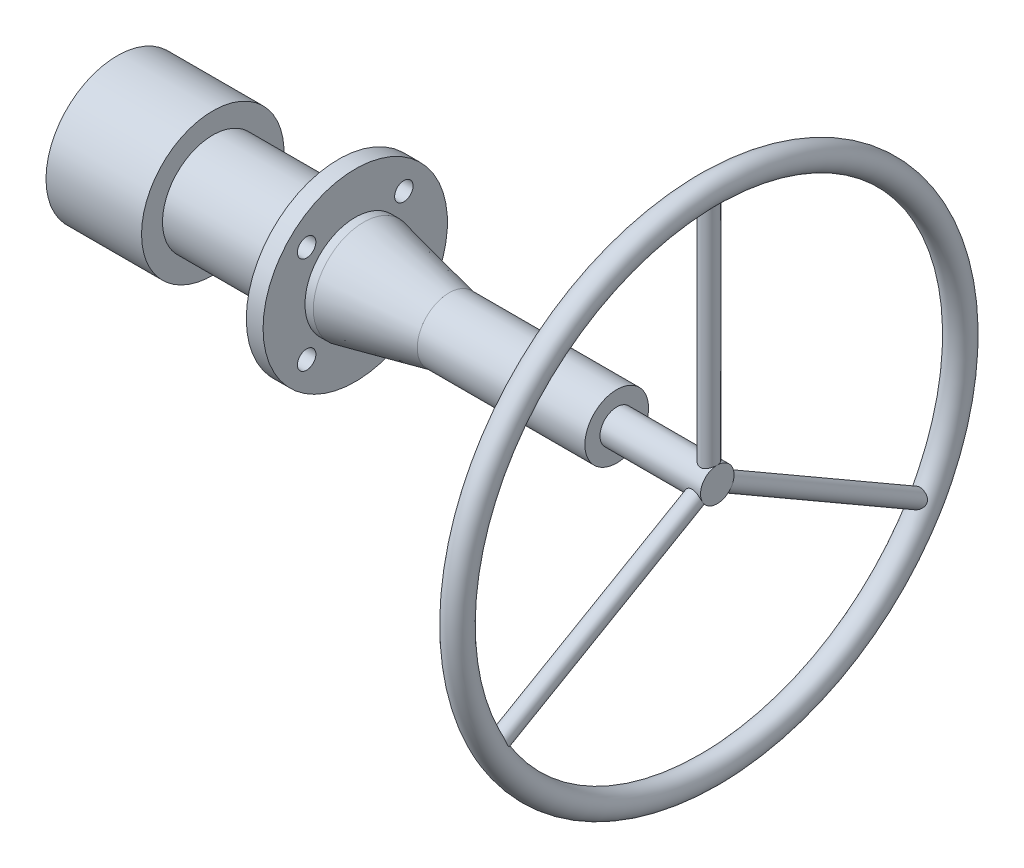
ISO-10303-21;
HEADER;
FILE_DESCRIPTION(('STEP AP214'),'2;1');
FILE_NAME('part.step','',(''),(''),'','','');
FILE_SCHEMA(('AUTOMOTIVE_DESIGN { 1 0 10303 214 1 1 1 1 }'));
ENDSEC;
DATA;
#1=APPLICATION_CONTEXT('core data for automotive mechanical design processes');
#2=APPLICATION_PROTOCOL_DEFINITION('international standard','automotive_design',2000,#1);
#3=PRODUCT_CONTEXT('',#1,'mechanical');
#4=PRODUCT('Part','Part','',(#3));
#5=PRODUCT_RELATED_PRODUCT_CATEGORY('part','',(#4));
#6=PRODUCT_DEFINITION_FORMATION('','',#4);
#7=PRODUCT_DEFINITION_CONTEXT('part definition',#1,'design');
#8=PRODUCT_DEFINITION('design','',#6,#7);
#9=PRODUCT_DEFINITION_SHAPE('','',#8);
#10=(LENGTH_UNIT() NAMED_UNIT(*) SI_UNIT(.MILLI.,.METRE.));
#11=(NAMED_UNIT(*) PLANE_ANGLE_UNIT() SI_UNIT($,.RADIAN.));
#12=(NAMED_UNIT(*) SI_UNIT($,.STERADIAN.) SOLID_ANGLE_UNIT());
#13=UNCERTAINTY_MEASURE_WITH_UNIT(LENGTH_MEASURE(1.E-05),#10,'distance_accuracy_value','');
#14=(GEOMETRIC_REPRESENTATION_CONTEXT(3) GLOBAL_UNCERTAINTY_ASSIGNED_CONTEXT((#13)) GLOBAL_UNIT_ASSIGNED_CONTEXT((#10,
#11,#12)) REPRESENTATION_CONTEXT('',''));
#15=CARTESIAN_POINT('',(0.,0.,0.));
#16=DIRECTION('',(0.,0.,1.));
#17=DIRECTION('',(1.,0.,0.));
#18=AXIS2_PLACEMENT_3D('',#15,#16,#17);
#19=CARTESIAN_POINT('',(0.,0.,0.));
#20=DIRECTION('',(-1.,0.,0.));
#21=DIRECTION('',(0.,0.,1.));
#22=AXIS2_PLACEMENT_3D('',#19,#20,#21);
#23=CYLINDRICAL_SURFACE('',#22,10.);
#24=CARTESIAN_POINT('',(298.,0.,0.));
#25=DIRECTION('',(-1.,0.,0.));
#26=DIRECTION('',(0.,0.,1.));
#27=AXIS2_PLACEMENT_3D('',#24,#25,#26);
#28=CIRCLE('',#27,10.);
#29=CARTESIAN_POINT('',(298.,0.,10.));
#30=VERTEX_POINT('',#29);
#31=EDGE_CURVE('E76',#30,#30,#28,.T.);
#32=ORIENTED_EDGE('',*,*,#31,.F.);
#33=EDGE_LOOP('',(#32));
#34=FACE_BOUND('',#33,.T.);
#35=CARTESIAN_POINT('',(358.,0.,0.));
#36=DIRECTION('',(-1.,0.,0.));
#37=DIRECTION('',(0.,0.,1.));
#38=AXIS2_PLACEMENT_3D('',#35,#36,#37);
#39=CIRCLE('',#38,10.);
#40=CARTESIAN_POINT('',(358.,-4.99999999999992,-8.66025403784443));
#41=VERTEX_POINT('',#40);
#42=CARTESIAN_POINT('',(358.,-5.00000000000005,8.66025403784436));
#43=VERTEX_POINT('',#42);
#44=EDGE_CURVE('E67',#41,#43,#39,.T.);
#45=ORIENTED_EDGE('',*,*,#44,.T.);
#46=CARTESIAN_POINT('',(353.,0.,10.));
#47=CARTESIAN_POINT('',(352.869668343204,-9.34111599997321E-07,10.0000003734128));
#48=CARTESIAN_POINT('',(352.739325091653,-0.00589547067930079,10.0000053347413));
#49=CARTESIAN_POINT('',(352.479644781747,-0.0293592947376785,9.99996359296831));
#50=CARTESIAN_POINT('',(352.3503082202,-0.0469340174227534,9.99991686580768));
#51=CARTESIAN_POINT('',(352.093486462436,-0.0934596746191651,9.99959036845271));
#52=CARTESIAN_POINT('',(351.966004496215,-0.122428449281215,9.99931023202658));
#53=CARTESIAN_POINT('',(351.713982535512,-0.191206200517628,9.99823044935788));
#54=CARTESIAN_POINT('',(351.589443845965,-0.231019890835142,9.99743057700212));
#55=CARTESIAN_POINT('',(351.222888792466,-0.365266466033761,9.99372940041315));
#56=CARTESIAN_POINT('',(350.986267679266,-0.474818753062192,9.98953309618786));
#57=CARTESIAN_POINT('',(350.532838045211,-0.728379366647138,9.97424195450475));
#58=CARTESIAN_POINT('',(350.316030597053,-0.872389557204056,9.96314674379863));
#59=CARTESIAN_POINT('',(349.888489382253,-1.20220329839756,9.92896818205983));
#60=CARTESIAN_POINT('',(349.679731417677,-1.39047423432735,9.90497155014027));
#61=CARTESIAN_POINT('',(349.292930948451,-1.79406390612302,9.83986870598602));
#62=CARTESIAN_POINT('',(349.114903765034,-2.00939604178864,9.7987539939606));
#63=CARTESIAN_POINT('',(348.868773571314,-2.35494300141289,9.71954505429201));
#64=CARTESIAN_POINT('',(348.7880868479,-2.47810047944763,9.68895977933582));
#65=CARTESIAN_POINT('',(348.637371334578,-2.72904495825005,9.62128714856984));
#66=CARTESIAN_POINT('',(348.567338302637,-2.85683009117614,9.58420239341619));
#67=CARTESIAN_POINT('',(348.438623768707,-3.11584683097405,9.50315285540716));
#68=CARTESIAN_POINT('',(348.37993934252,-3.24707754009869,9.45918985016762));
#69=CARTESIAN_POINT('',(348.274568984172,-3.51176435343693,9.36414822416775));
#70=CARTESIAN_POINT('',(348.227881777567,-3.6452202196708,9.31307036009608));
#71=CARTESIAN_POINT('',(348.149984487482,-3.90348914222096,9.20765025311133));
#72=CARTESIAN_POINT('',(348.117909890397,-4.02824193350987,9.15379844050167));
#73=CARTESIAN_POINT('',(348.065033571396,-4.27738297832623,9.04006301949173));
#74=CARTESIAN_POINT('',(348.04423075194,-4.40177126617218,8.98017999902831));
#75=CARTESIAN_POINT('',(348.014180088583,-4.64899033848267,8.85472158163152));
#76=CARTESIAN_POINT('',(348.004926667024,-4.77182184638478,8.78914894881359));
#77=CARTESIAN_POINT('',(347.998085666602,-5.01487351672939,8.65277164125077));
#78=CARTESIAN_POINT('',(348.000497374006,-5.13509383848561,8.5819672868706));
#79=CARTESIAN_POINT('',(348.016230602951,-5.36154611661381,8.44215370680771));
#80=CARTESIAN_POINT('',(348.028581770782,-5.468083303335,8.37352696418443));
#81=CARTESIAN_POINT('',(348.062832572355,-5.67745140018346,8.23300958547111));
#82=CARTESIAN_POINT('',(348.084735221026,-5.78028112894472,8.16111792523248));
#83=CARTESIAN_POINT('',(348.137846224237,-5.98156141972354,8.01476102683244));
#84=CARTESIAN_POINT('',(348.169051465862,-6.08001343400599,7.94029665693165));
#85=CARTESIAN_POINT('',(348.240447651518,-6.27210025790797,7.78946136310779));
#86=CARTESIAN_POINT('',(348.280642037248,-6.36573320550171,7.71308971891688));
#87=CARTESIAN_POINT('',(348.415374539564,-6.64122255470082,7.48012808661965));
#88=CARTESIAN_POINT('',(348.523368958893,-6.81507280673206,7.32159794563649));
#89=CARTESIAN_POINT('',(348.771329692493,-7.1393212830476,7.00581932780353));
#90=CARTESIAN_POINT('',(348.911307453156,-7.28971107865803,6.84857133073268));
#91=CARTESIAN_POINT('',(349.234463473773,-7.57973235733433,6.52678012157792));
#92=CARTESIAN_POINT('',(349.420474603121,-7.71700308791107,6.36295239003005));
#93=CARTESIAN_POINT('',(349.822989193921,-7.963345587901,6.05182370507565));
#94=CARTESIAN_POINT('',(350.039515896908,-8.07239568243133,5.90453550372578));
#95=CARTESIAN_POINT('',(350.391193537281,-8.21811110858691,5.69827806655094));
#96=CARTESIAN_POINT('',(350.51705093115,-8.26477945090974,5.63021595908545));
#97=CARTESIAN_POINT('',(350.77551387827,-8.35031110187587,5.50256293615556));
#98=CARTESIAN_POINT('',(350.908116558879,-8.38917769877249,5.44296845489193));
#99=CARTESIAN_POINT('',(351.179203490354,-8.45912508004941,5.33361233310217));
#100=CARTESIAN_POINT('',(351.317684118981,-8.49021058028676,5.28384474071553));
#101=CARTESIAN_POINT('',(351.599621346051,-8.54462989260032,5.19538281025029));
#102=CARTESIAN_POINT('',(351.743077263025,-8.56796476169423,5.15668696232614));
#103=CARTESIAN_POINT('',(352.022256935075,-8.60532440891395,5.09407632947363));
#104=CARTESIAN_POINT('',(352.157693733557,-8.61993998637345,5.06923390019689));
#105=CARTESIAN_POINT('',(352.430671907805,-8.64256165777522,5.03056991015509));
#106=CARTESIAN_POINT('',(352.568213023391,-8.65056856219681,5.01674699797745));
#107=CARTESIAN_POINT('',(352.844115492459,-8.65995552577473,5.00052587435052));
#108=CARTESIAN_POINT('',(352.98247633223,-8.66133936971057,4.99812113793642));
#109=CARTESIAN_POINT('',(353.258820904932,-8.65748750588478,5.0047902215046));
#110=CARTESIAN_POINT('',(353.396804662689,-8.65225224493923,5.01386326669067));
#111=CARTESIAN_POINT('',(353.656088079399,-8.63611200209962,5.04160620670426));
#112=CARTESIAN_POINT('',(353.777556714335,-8.62589237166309,5.05911349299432));
#113=CARTESIAN_POINT('',(354.018417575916,-8.60023357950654,5.10260804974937));
#114=CARTESIAN_POINT('',(354.137809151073,-8.58479281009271,5.12859793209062));
#115=CARTESIAN_POINT('',(354.491710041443,-8.53065300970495,5.21851847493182));
#116=CARTESIAN_POINT('',(354.722114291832,-8.48412609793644,5.29441916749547));
#117=CARTESIAN_POINT('',(355.177093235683,-8.36765003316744,5.47673010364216));
#118=CARTESIAN_POINT('',(355.400903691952,-8.29671587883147,5.58439058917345));
#119=CARTESIAN_POINT('',(355.82733774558,-8.13183002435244,5.82187433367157));
#120=CARTESIAN_POINT('',(356.029950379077,-8.03786649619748,5.95170897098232));
#121=CARTESIAN_POINT('',(356.434891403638,-7.81316617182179,6.24440674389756));
#122=CARTESIAN_POINT('',(356.63396448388,-7.67928699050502,6.40937023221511));
#123=CARTESIAN_POINT('',(356.997082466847,-7.38113812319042,6.75055360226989));
#124=CARTESIAN_POINT('',(357.161115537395,-7.21685820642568,6.92677726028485));
#125=CARTESIAN_POINT('',(357.379009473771,-6.94592200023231,7.1952083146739));
#126=CARTESIAN_POINT('',(357.44766209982,-6.85007940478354,7.28661016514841));
#127=CARTESIAN_POINT('',(357.573756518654,-6.65084962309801,7.46889441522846));
#128=CARTESIAN_POINT('',(357.631203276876,-6.54746580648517,7.55977702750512));
#129=CARTESIAN_POINT('',(357.734217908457,-6.33362082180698,7.73981797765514));
#130=CARTESIAN_POINT('',(357.779791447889,-6.2231630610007,7.82897711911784));
#131=CARTESIAN_POINT('',(357.858509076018,-5.99575978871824,8.00446610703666));
#132=CARTESIAN_POINT('',(357.891654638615,-5.878815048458,8.09079628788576));
#133=CARTESIAN_POINT('',(357.942595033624,-5.65028880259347,8.25178440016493));
#134=CARTESIAN_POINT('',(357.961519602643,-5.53920023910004,8.32678637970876));
#135=CARTESIAN_POINT('',(357.988493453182,-5.31315602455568,8.47280776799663));
#136=CARTESIAN_POINT('',(357.996543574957,-5.19820067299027,8.54382748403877));
#137=CARTESIAN_POINT('',(358.001663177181,-4.96535198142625,8.68121816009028));
#138=CARTESIAN_POINT('',(357.998735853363,-4.84745950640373,8.74759046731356));
#139=CARTESIAN_POINT('',(357.981947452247,-4.60969013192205,8.87518799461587));
#140=CARTESIAN_POINT('',(357.968086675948,-4.48981328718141,8.93641335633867));
#141=CARTESIAN_POINT('',(357.930882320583,-4.25707141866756,9.04947241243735));
#142=CARTESIAN_POINT('',(357.908227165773,-4.14426750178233,9.10165950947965));
#143=CARTESIAN_POINT('',(357.853786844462,-3.91865622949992,9.20105233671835));
#144=CARTESIAN_POINT('',(357.821998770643,-3.80584888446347,9.24825647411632));
#145=CARTESIAN_POINT('',(357.713391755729,-3.46873859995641,9.38222322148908));
#146=CARTESIAN_POINT('',(357.623298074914,-3.24555058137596,9.46143479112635));
#147=CARTESIAN_POINT('',(357.40635777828,-2.7994706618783,9.60313515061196));
#148=CARTESIAN_POINT('',(357.278104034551,-2.57699970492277,9.66476379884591));
#149=CARTESIAN_POINT('',(356.990209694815,-2.14846010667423,9.76897052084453));
#150=CARTESIAN_POINT('',(356.830554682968,-1.94239906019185,9.8115398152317));
#151=CARTESIAN_POINT('',(356.466024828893,-1.532908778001,9.88421166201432));
#152=CARTESIAN_POINT('',(356.258230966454,-1.33178234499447,9.9126519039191));
#153=CARTESIAN_POINT('',(355.812702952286,-0.963337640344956,9.95522227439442));
#154=CARTESIAN_POINT('',(355.574942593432,-0.796049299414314,9.96933977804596));
#155=CARTESIAN_POINT('',(355.195780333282,-0.574419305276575,9.98377555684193));
#156=CARTESIAN_POINT('',(355.063373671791,-0.504576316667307,9.98746548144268));
#157=CARTESIAN_POINT('',(354.792744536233,-0.377227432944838,9.99308561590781));
#158=CARTESIAN_POINT('',(354.654525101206,-0.319715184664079,9.99501673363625));
#159=CARTESIAN_POINT('',(354.373592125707,-0.2182343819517,9.99774721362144));
#160=CARTESIAN_POINT('',(354.230891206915,-0.174230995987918,9.99854950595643));
#161=CARTESIAN_POINT('',(353.94190785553,-0.100544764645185,9.99956286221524));
#162=CARTESIAN_POINT('',(353.795628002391,-0.0708519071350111,9.99977433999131));
#163=CARTESIAN_POINT('',(353.541002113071,-0.032512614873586,9.9999596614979));
#164=CARTESIAN_POINT('',(353.433175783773,-0.0203365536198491,9.99998254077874));
#165=CARTESIAN_POINT('',(353.216902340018,-0.00407958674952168,10.0000025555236));
#166=CARTESIAN_POINT('',(353.108455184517,7.77318791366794E-07,9.99999968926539));
#167=CARTESIAN_POINT('',(353.,0.,10.));
#168=B_SPLINE_CURVE_WITH_KNOTS('',3,(#46,#47,#48,#49,#50,#51,#52,#53,#54,#55,#56,#57,#58,#59,
#60,#61,#62,#63,#64,#65,#66,#67,#68,#69,#70,#71,#72,#73,#74,#75,#76,#77,#78,#79,#80,#81,#82,#83,
#84,#85,#86,#87,#88,#89,#90,#91,#92,#93,#94,#95,#96,#97,#98,#99,#100,#101,#102,#103,#104,#105,
#106,#107,#108,#109,#110,#111,#112,#113,#114,#115,#116,#117,#118,#119,#120,#121,#122,#123,#124,
#125,#126,#127,#128,#129,#130,#131,#132,#133,#134,#135,#136,#137,#138,#139,#140,#141,#142,#143,
#144,#145,#146,#147,#148,#149,#150,#151,#152,#153,#154,#155,#156,#157,#158,#159,#160,#161,#162,
#163,#164,#165,#166,#167),.UNSPECIFIED.,.T.,.F.,(4,2,2,2,2,2,2,2,2,2,2,2,2,2,2,2,2,2,2,2,2,2,2,
2,2,2,2,2,2,2,2,2,2,2,2,2,2,2,2,2,2,2,2,2,2,2,2,2,2,2,2,2,2,2,2,2,2,2,2,2,4),(0.,
0.390882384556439,0.781946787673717,1.17362595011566,1.56547562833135,2.34415414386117,
3.12287479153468,3.96582272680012,4.80918971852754,5.25982992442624,5.7102902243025,
6.16063429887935,6.61093051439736,7.02920538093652,7.44743951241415,7.86547158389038,
8.28347807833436,8.66500933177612,9.04666110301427,9.42818530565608,9.80985583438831,
10.5829669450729,11.3563551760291,12.202849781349,13.0499926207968,13.5010020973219,
13.9518210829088,14.4023661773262,14.8528498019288,15.2676702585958,15.6824398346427,
16.0969723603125,16.5114769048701,16.8804871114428,17.2496110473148,17.9873544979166,
18.7592666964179,19.5315761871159,20.4012390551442,21.2711951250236,21.7182117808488,
22.1650299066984,22.6116344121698,23.0581859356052,23.4637505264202,23.8692837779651,
24.2746989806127,24.6801030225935,25.0586722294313,25.4373620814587,26.1940875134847,
26.9831783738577,27.77263234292,28.6406529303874,29.5094379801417,29.9581473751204,
30.4066250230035,30.8539364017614,31.3009343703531,31.6261844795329,31.9514563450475),.UNSPECIFIED.);
#169=EDGE_CURVE('E142',#43,#43,#168,.T.);
#170=ORIENTED_EDGE('',*,*,#169,.F.);
#171=CARTESIAN_POINT('',(358.,10.,0.));
#172=VERTEX_POINT('',#171);
#173=EDGE_CURVE('E61',#43,#172,#39,.T.);
#174=ORIENTED_EDGE('',*,*,#173,.T.);
#175=CARTESIAN_POINT('',(353.,8.66025403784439,-4.99999999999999));
#176=CARTESIAN_POINT('',(352.869668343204,8.66025482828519,-4.99999937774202));
#177=CARTESIAN_POINT('',(352.739325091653,8.66320639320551,-4.99489703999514));
#178=CARTESIAN_POINT('',(352.479644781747,8.67490215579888,-4.97455590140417));
#179=CARTESIAN_POINT('',(352.3503082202,8.68364905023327,-4.9593123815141));
#180=CARTESIAN_POINT('',(352.093486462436,8.70662912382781,-4.91885673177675));
#181=CARTESIAN_POINT('',(351.966004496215,8.72087090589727,-4.89362896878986));
#182=CARTESIAN_POINT('',(351.713982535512,8.75432466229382,-4.83352579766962));
#183=CARTESIAN_POINT('',(351.589443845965,8.77353879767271,-4.79864619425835));
#184=CARTESIAN_POINT('',(351.222888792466,8.83745677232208,-4.68053466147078));
#185=CARTESIAN_POINT('',(350.986267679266,8.8885988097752,-4.58356144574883));
#186=CARTESIAN_POINT('',(350.532838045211,9.00213659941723,-4.35632594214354));
#187=CARTESIAN_POINT('',(350.316030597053,9.06453296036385,-4.22606185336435));
#188=CARTESIAN_POINT('',(349.888489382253,9.19984032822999,-3.92334549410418));
#189=CARTESIAN_POINT('',(349.679731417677,9.27319410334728,-3.74829976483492));
#190=CARTESIAN_POINT('',(349.292930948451,9.41860822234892,-3.36622943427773));
#191=CARTESIAN_POINT('',(349.114903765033,9.49066790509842,-3.15918897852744));
#192=CARTESIAN_POINT('',(348.868773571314,9.59484443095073,-2.82033206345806));
#193=CARTESIAN_POINT('',(348.7880868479,9.62993554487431,-2.69838192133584));
#194=CARTESIAN_POINT('',(348.637371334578,9.69680156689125,-2.44722131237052));
#195=CARTESIAN_POINT('',(348.567338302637,9.72857779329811,-2.31801376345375));
#196=CARTESIAN_POINT('',(348.438623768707,9.78789520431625,-2.05317391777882));
#197=CARTESIAN_POINT('',(348.37993934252,9.81543747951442,-1.91754328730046));
#198=CARTESIAN_POINT('',(348.274568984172,9.86547242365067,-1.64079696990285));
#199=CARTESIAN_POINT('',(348.227881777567,9.88796562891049,-1.49968186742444));
#200=CARTESIAN_POINT('',(348.149984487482,9.92580359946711,-1.2233043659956));
#201=CARTESIAN_POINT('',(348.117909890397,9.94154295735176,-1.08833937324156));
#202=CARTESIAN_POINT('',(348.065033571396,9.96761571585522,-0.815709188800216));
#203=CARTESIAN_POINT('',(348.04423075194,9.97794964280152,-0.678044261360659));
#204=CARTESIAN_POINT('',(348.014180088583,9.99290900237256,-0.401217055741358));
#205=CARTESIAN_POINT('',(348.004926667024,9.99753719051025,-0.262055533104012));
#206=CARTESIAN_POINT('',(347.998085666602,10.0009568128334,0.0166220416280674));
#207=CARTESIAN_POINT('',(348.000497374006,9.99974860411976,0.156138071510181));
#208=CARTESIAN_POINT('',(348.016230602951,9.99189263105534,0.422158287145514));
#209=CARTESIAN_POINT('',(348.028581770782,9.9857287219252,0.548735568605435));
#210=CARTESIAN_POINT('',(348.062832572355,9.9687211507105,0.800312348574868));
#211=CARTESIAN_POINT('',(348.084735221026,9.95787601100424,0.925311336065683));
#212=CARTESIAN_POINT('',(348.137846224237,9.93176736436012,1.17280363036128));
#213=CARTESIAN_POINT('',(348.169051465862,9.91650533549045,1.29529776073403));
#214=CARTESIAN_POINT('',(348.240447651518,9.88192155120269,1.53706747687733));
#215=CARTESIAN_POINT('',(348.280642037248,9.86259824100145,1.65634181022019));
#216=CARTESIAN_POINT('',(348.415374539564,9.79859222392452,2.01140340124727));
#217=CARTESIAN_POINT('',(348.523368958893,9.74822622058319,2.24122720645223));
#218=CARTESIAN_POINT('',(348.771329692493,9.63687815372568,2.67992393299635));
#219=CARTESIAN_POINT('',(348.911307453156,9.57589229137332,2.88878931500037));
#220=CARTESIAN_POINT('',(349.234463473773,9.44222356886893,3.30085071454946));
#221=CARTESIAN_POINT('',(349.420474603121,9.36897995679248,3.5016445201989));
#222=CARTESIAN_POINT('',(349.822989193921,9.22270586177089,3.87054772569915));
#223=CARTESIAN_POINT('',(350.039515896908,9.14967558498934,4.03863197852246));
#224=CARTESIAN_POINT('',(350.391193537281,9.04390911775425,4.26795395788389));
#225=CARTESIAN_POINT('',(350.51705093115,9.00829977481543,4.34240098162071));
#226=CARTESIAN_POINT('',(350.77551387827,8.94051483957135,4.48030007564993));
#227=CARTESIAN_POINT('',(350.908116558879,8.90833780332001,4.54375677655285));
#228=CARTESIAN_POINT('',(351.179203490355,8.84860631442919,4.65901104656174));
#229=CARTESIAN_POINT('',(351.317684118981,8.82104906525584,4.71081567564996));
#230=CARTESIAN_POINT('',(351.599621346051,8.77164844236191,4.80217514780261));
#231=CARTESIAN_POINT('',(351.743077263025,8.74980428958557,4.841731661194));
#232=CARTESIAN_POINT('',(352.022256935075,8.71426171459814,4.90539138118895));
#233=CARTESIAN_POINT('',(352.157693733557,8.70005532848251,4.93047005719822));
#234=CARTESIAN_POINT('',(352.430671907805,8.67788216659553,4.96939299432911));
#235=CARTESIAN_POINT('',(352.568213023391,8.66991462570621,4.9832386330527));
#236=CARTESIAN_POINT('',(352.844115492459,8.66056020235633,4.99947854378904));
#237=CARTESIAN_POINT('',(352.98247633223,8.65916956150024,5.0018793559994));
#238=CARTESIAN_POINT('',(353.258820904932,8.66301922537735,4.99520900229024));
#239=CARTESIAN_POINT('',(353.396804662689,8.66825908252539,4.98613861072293));
#240=CARTESIAN_POINT('',(353.656088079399,8.68421505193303,4.95828928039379));
#241=CARTESIAN_POINT('',(353.777556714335,8.69426699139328,4.94068517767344));
#242=CARTESIAN_POINT('',(354.018417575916,8.71910498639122,4.89671673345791));
#243=CARTESIAN_POINT('',(354.137809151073,8.7338925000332,4.87034969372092));
#244=CARTESIAN_POINT('',(354.491710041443,8.78469607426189,4.77850297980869));
#245=CARTESIAN_POINT('',(354.722114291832,8.82716454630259,4.7002591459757));
#246=CARTESIAN_POINT('',(355.177093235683,8.92681241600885,4.50823244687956));
#247=CARTESIAN_POINT('',(355.400903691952,8.98458205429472,4.39297142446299));
#248=CARTESIAN_POINT('',(355.82733774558,9.10780608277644,4.13143421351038));
#249=CARTESIAN_POINT('',(356.029950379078,9.1732644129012,3.98514209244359));
#250=CARTESIAN_POINT('',(356.434891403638,9.31439795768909,3.64419701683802));
#251=CARTESIAN_POINT('',(356.63396448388,9.39032093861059,3.44577250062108));
#252=CARTESIAN_POINT('',(356.997082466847,9.5367199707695,3.01697632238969));
#253=CARTESIAN_POINT('',(357.161115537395,9.60719417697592,2.78659391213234));
#254=CARTESIAN_POINT('',(357.379009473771,9.70419418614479,2.41774074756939));
#255=CARTESIAN_POINT('',(357.44766209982,9.73542921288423,2.28903769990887));
#256=CARTESIAN_POINT('',(357.573756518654,9.79367711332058,2.02535752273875));
#257=CARTESIAN_POINT('',(357.631203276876,9.82069185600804,1.8903832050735));
#258=CARTESIAN_POINT('',(357.734217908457,9.86968940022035,1.61516754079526));
#259=CARTESIAN_POINT('',(357.779791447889,9.89167460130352,1.47492874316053));
#260=CARTESIAN_POINT('',(357.858509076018,9.92995088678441,1.19024723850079));
#261=CARTESIAN_POINT('',(357.891654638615,9.94624264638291,1.0458050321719));
#262=CARTESIAN_POINT('',(357.942595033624,9.97139931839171,0.767401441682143));
#263=CARTESIAN_POINT('',(357.961519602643,9.98080865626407,0.633694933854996));
#264=CARTESIAN_POINT('',(357.988493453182,9.99424478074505,0.364924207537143));
#265=CARTESIAN_POINT('',(357.996543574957,9.9982719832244,0.229860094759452));
#266=CARTESIAN_POINT('',(358.001663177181,10.0008314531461,-0.0404881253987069));
#267=CARTESIAN_POINT('',(357.998735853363,9.99936531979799,-0.17577215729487));
#268=CARTESIAN_POINT('',(357.981947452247,9.99098333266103,-0.445485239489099));
#269=CARTESIAN_POINT('',(357.968086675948,9.98406762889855,-0.579914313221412));
#270=CARTESIAN_POINT('',(357.930882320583,9.96560870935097,-0.838004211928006));
#271=CARTESIAN_POINT('',(357.908227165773,9.95440210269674,-0.961788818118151));
#272=CARTESIAN_POINT('',(357.853786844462,9.92767317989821,-1.20687032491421));
#273=CARTESIAN_POINT('',(357.821998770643,9.91214948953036,-1.32816642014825));
#274=CARTESIAN_POINT('',(357.713391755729,9.859612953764,-1.68709586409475));
#275=CARTESIAN_POINT('',(357.623298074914,9.81661817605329,-1.91998814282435));
#276=CARTESIAN_POINT('',(357.40635777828,9.71629432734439,-2.37715486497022));
#277=CARTESIAN_POINT('',(357.278104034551,9.65843082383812,-2.60063468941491));
#278=CARTESIAN_POINT('',(356.990209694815,9.53440669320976,-3.02386422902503));
#279=CARTESIAN_POINT('',(356.830554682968,9.46824226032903,-3.22360297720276));
#280=CARTESIAN_POINT('',(356.466024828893,9.32643278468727,-3.61456788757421));
#281=CARTESIAN_POINT('',(356.258230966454,9.25049954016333,-3.8029686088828));
#282=CARTESIAN_POINT('',(355.812702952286,9.10314421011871,-4.1433362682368));
#283=CARTESIAN_POINT('',(355.574942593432,9.03172615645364,-4.29527097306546));
#284=CARTESIAN_POINT('',(355.195780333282,8.93341291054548,-4.49442606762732));
#285=CARTESIAN_POINT('',(355.063373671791,8.90168698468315,-4.55675683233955));
#286=CARTESIAN_POINT('',(354.792744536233,8.84287972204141,-4.66985426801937));
#287=CARTESIAN_POINT('',(354.654525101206,8.81579599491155,-4.72062689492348));
#288=CARTESIAN_POINT('',(354.373592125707,8.76742025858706,-4.80987708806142));
#289=CARTESIAN_POINT('',(354.230891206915,8.74611337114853,-4.84838628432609));
#290=CARTESIAN_POINT('',(353.941907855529,8.71014784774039,-4.91270711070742));
#291=CARTESIAN_POINT('',(353.795628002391,8.69548456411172,-4.93852761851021));
#292=CARTESIAN_POINT('',(353.541002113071,8.67647541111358,-4.97182308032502));
#293=CARTESIAN_POINT('',(353.433175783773,8.67040719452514,-4.98237929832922));
#294=CARTESIAN_POINT('',(353.216902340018,8.66229604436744,-4.99646825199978));
#295=CARTESIAN_POINT('',(353.108455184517,8.66025338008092,-5.00000051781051));
#296=CARTESIAN_POINT('',(353.,8.66025403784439,-4.99999999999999));
#297=B_SPLINE_CURVE_WITH_KNOTS('',3,(#175,#176,#177,#178,#179,#180,#181,#182,#183,#184,#185,
#186,#187,#188,#189,#190,#191,#192,#193,#194,#195,#196,#197,#198,#199,#200,#201,#202,#203,#204,
#205,#206,#207,#208,#209,#210,#211,#212,#213,#214,#215,#216,#217,#218,#219,#220,#221,#222,#223,
#224,#225,#226,#227,#228,#229,#230,#231,#232,#233,#234,#235,#236,#237,#238,#239,#240,#241,#242,
#243,#244,#245,#246,#247,#248,#249,#250,#251,#252,#253,#254,#255,#256,#257,#258,#259,#260,#261,
#262,#263,#264,#265,#266,#267,#268,#269,#270,#271,#272,#273,#274,#275,#276,#277,#278,#279,#280,
#281,#282,#283,#284,#285,#286,#287,#288,#289,#290,#291,#292,#293,#294,#295,#296),.UNSPECIFIED.,
.T.,.F.,(4,2,2,2,2,2,2,2,2,2,2,2,2,2,2,2,2,2,2,2,2,2,2,2,2,2,2,2,2,2,2,2,2,2,2,2,2,2,2,2,2,2,2,
2,2,2,2,2,2,2,2,2,2,2,2,2,2,2,2,2,4),(0.,0.390882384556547,0.781946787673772,1.17362595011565,
1.56547562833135,2.34415414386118,3.12287479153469,3.96582272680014,4.80918971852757,
5.25982992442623,5.7102902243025,6.16063429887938,6.61093051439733,7.0292053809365,
7.44743951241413,7.86547158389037,8.28347807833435,8.66500933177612,9.04666110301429,
9.42818530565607,9.8098558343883,10.5829669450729,11.3563551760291,12.202849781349,
13.0499926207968,13.5010020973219,13.9518210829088,14.4023661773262,14.8528498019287,
15.2676702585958,15.6824398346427,16.0969723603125,16.5114769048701,16.8804871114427,
17.2496110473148,17.9873544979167,18.7592666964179,19.5315761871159,20.4012390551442,
21.2711951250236,21.7182117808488,22.1650299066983,22.6116344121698,23.0581859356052,
23.4637505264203,23.8692837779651,24.2746989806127,24.6801030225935,25.0586722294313,
25.4373620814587,26.1940875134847,26.9831783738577,27.77263234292,28.6406529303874,
29.5094379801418,29.9581473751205,30.4066250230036,30.8539364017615,31.3009343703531,
31.6261844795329,31.9514563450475),.UNSPECIFIED.);
#298=EDGE_CURVE('E74',#172,#172,#297,.T.);
#299=ORIENTED_EDGE('',*,*,#298,.F.);
#300=EDGE_CURVE('E70',#172,#41,#39,.T.);
#301=ORIENTED_EDGE('',*,*,#300,.T.);
#302=CARTESIAN_POINT('',(353.,-8.66025403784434,-5.0000000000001));
#303=CARTESIAN_POINT('',(352.869668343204,-8.66025389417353,-5.00000099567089));
#304=CARTESIAN_POINT('',(352.739325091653,-8.6573109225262,-5.00510829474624));
#305=CARTESIAN_POINT('',(352.479644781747,-8.64554286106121,-5.0254076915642));
#306=CARTESIAN_POINT('',(352.3503082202,-8.6367150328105,-5.04060448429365));
#307=CARTESIAN_POINT('',(352.093486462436,-8.61316944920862,-5.08073363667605));
#308=CARTESIAN_POINT('',(351.966004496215,-8.59844245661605,-5.10568126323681));
#309=CARTESIAN_POINT('',(351.713982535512,-8.56311846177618,-5.16470465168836));
#310=CARTESIAN_POINT('',(351.589443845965,-8.54251890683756,-5.19878438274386));
#311=CARTESIAN_POINT('',(351.222888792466,-8.47219030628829,-5.31319473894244));
#312=CARTESIAN_POINT('',(350.986267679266,-8.41378005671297,-5.4059716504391));
#313=CARTESIAN_POINT('',(350.532838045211,-8.27375723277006,-5.61791601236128));
#314=CARTESIAN_POINT('',(350.316030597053,-8.19214340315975,-5.73708489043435));
#315=CARTESIAN_POINT('',(349.888489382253,-7.99763702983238,-6.00562268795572));
#316=CARTESIAN_POINT('',(349.679731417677,-7.88271986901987,-6.15667178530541));
#317=CARTESIAN_POINT('',(349.292930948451,-7.62454431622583,-6.47363927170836));
#318=CARTESIAN_POINT('',(349.114903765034,-7.48127186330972,-6.63956501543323));
#319=CARTESIAN_POINT('',(348.868773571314,-7.23990142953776,-6.89921299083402));
#320=CARTESIAN_POINT('',(348.7880868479,-7.15183506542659,-6.99057785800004));
#321=CARTESIAN_POINT('',(348.637371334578,-6.96775660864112,-7.17406583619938));
#322=CARTESIAN_POINT('',(348.567338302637,-6.8717477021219,-7.26618862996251));
#323=CARTESIAN_POINT('',(348.438623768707,-6.67204837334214,-7.4499789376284));
#324=CARTESIAN_POINT('',(348.37993934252,-6.56835993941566,-7.54164656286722));
#325=CARTESIAN_POINT('',(348.274568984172,-6.35370807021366,-7.72335125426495));
#326=CARTESIAN_POINT('',(348.227881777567,-6.24274540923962,-7.8133884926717));
#327=CARTESIAN_POINT('',(348.149984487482,-6.02231445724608,-7.9843458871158));
#328=CARTESIAN_POINT('',(348.117909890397,-5.91330102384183,-8.06545906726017));
#329=CARTESIAN_POINT('',(348.065033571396,-5.69023273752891,-8.22435383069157));
#330=CARTESIAN_POINT('',(348.04423075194,-5.57617837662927,-8.3021357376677));
#331=CARTESIAN_POINT('',(348.014180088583,-5.34391866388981,-8.45350452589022));
#332=CARTESIAN_POINT('',(348.004926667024,-5.22571534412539,-8.52709341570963));
#333=CARTESIAN_POINT('',(347.998085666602,-4.98608329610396,-8.66939368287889));
#334=CARTESIAN_POINT('',(348.000497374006,-4.86465476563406,-8.73810535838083));
#335=CARTESIAN_POINT('',(348.016230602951,-4.63034651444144,-8.86431199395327));
#336=CARTESIAN_POINT('',(348.028581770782,-4.5176454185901,-8.9222625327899));
#337=CARTESIAN_POINT('',(348.062832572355,-4.29126975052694,-9.03332193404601));
#338=CARTESIAN_POINT('',(348.084735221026,-4.17759488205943,-9.08642926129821));
#339=CARTESIAN_POINT('',(348.137846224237,-3.95020594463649,-9.18756465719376));
#340=CARTESIAN_POINT('',(348.169051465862,-3.83649190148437,-9.23559441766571));
#341=CARTESIAN_POINT('',(348.240447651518,-3.60982129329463,-9.32652883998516));
#342=CARTESIAN_POINT('',(348.280642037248,-3.49686503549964,-9.36943152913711));
#343=CARTESIAN_POINT('',(348.415374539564,-3.15736966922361,-9.49153148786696));
#344=CARTESIAN_POINT('',(348.523368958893,-2.93315341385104,-9.56282515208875));
#345=CARTESIAN_POINT('',(348.771329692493,-2.497556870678,-9.68574326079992));
#346=CARTESIAN_POINT('',(348.911307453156,-2.2861812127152,-9.73736064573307));
#347=CARTESIAN_POINT('',(349.234463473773,-1.86249121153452,-9.82763083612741));
#348=CARTESIAN_POINT('',(349.420474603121,-1.65197686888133,-9.86459691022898));
#349=CARTESIAN_POINT('',(349.822989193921,-1.2593602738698,-9.92237143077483));
#350=CARTESIAN_POINT('',(350.039515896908,-1.07727990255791,-9.94316748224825));
#351=CARTESIAN_POINT('',(350.391193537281,-0.825798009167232,-9.96623202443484));
#352=CARTESIAN_POINT('',(350.51705093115,-0.743520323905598,-9.97261694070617));
#353=CARTESIAN_POINT('',(350.77551387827,-0.590203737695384,-9.98286301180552));
#354=CARTESIAN_POINT('',(350.908116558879,-0.519160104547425,-9.98672523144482));
#355=CARTESIAN_POINT('',(351.179203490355,-0.389481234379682,-9.99262337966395));
#356=CARTESIAN_POINT('',(351.317684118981,-0.330838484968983,-9.99466041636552));
#357=CARTESIAN_POINT('',(351.599621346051,-0.227018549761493,-9.99755795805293));
#358=CARTESIAN_POINT('',(351.743077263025,-0.181839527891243,-9.99841862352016));
#359=CARTESIAN_POINT('',(352.022256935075,-0.108937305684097,-9.9994677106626));
#360=CARTESIAN_POINT('',(352.157693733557,-0.0801153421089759,-9.99970395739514));
#361=CARTESIAN_POINT('',(352.430671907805,-0.0353205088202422,-9.99996290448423));
#362=CARTESIAN_POINT('',(352.568213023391,-0.0193460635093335,-9.99998563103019));
#363=CARTESIAN_POINT('',(352.844115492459,-0.000604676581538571,-10.0000044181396));
#364=CARTESIAN_POINT('',(352.98247633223,0.00216980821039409,-10.0000004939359));
#365=CARTESIAN_POINT('',(353.258820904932,-0.00553171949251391,-9.9999992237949));
#366=CARTESIAN_POINT('',(353.396804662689,-0.0160068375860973,-10.0000018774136));
#367=CARTESIAN_POINT('',(353.656088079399,-0.0481030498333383,-9.99989548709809));
#368=CARTESIAN_POINT('',(353.777556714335,-0.0683746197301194,-9.9997986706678));
#369=CARTESIAN_POINT('',(354.018417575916,-0.118871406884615,-9.99932478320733));
#370=CARTESIAN_POINT('',(354.137809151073,-0.149099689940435,-9.9989476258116));
#371=CARTESIAN_POINT('',(354.491710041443,-0.254043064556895,-9.99702145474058));
#372=CARTESIAN_POINT('',(354.722114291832,-0.343038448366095,-9.99467831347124));
#373=CARTESIAN_POINT('',(355.177093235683,-0.559162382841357,-9.98496255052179));
#374=CARTESIAN_POINT('',(355.400903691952,-0.687866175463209,-9.97736201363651));
#375=CARTESIAN_POINT('',(355.82733774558,-0.97597605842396,-9.95330854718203));
#376=CARTESIAN_POINT('',(356.029950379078,-1.13539791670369,-9.93685106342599));
#377=CARTESIAN_POINT('',(356.434891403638,-1.50123178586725,-9.88860376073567));
#378=CARTESIAN_POINT('',(356.63396448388,-1.71103394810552,-9.85514273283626));
#379=CARTESIAN_POINT('',(356.997082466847,-2.15558184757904,-9.76752992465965));
#380=CARTESIAN_POINT('',(357.161115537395,-2.3903359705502,-9.71337117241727));
#381=CARTESIAN_POINT('',(357.379009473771,-2.75827218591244,-9.61294906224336));
#382=CARTESIAN_POINT('',(357.44766209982,-2.88534980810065,-9.57564786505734));
#383=CARTESIAN_POINT('',(357.573756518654,-3.14282749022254,-9.49425193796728));
#384=CARTESIAN_POINT('',(357.631203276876,-3.27322604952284,-9.45016023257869));
#385=CARTESIAN_POINT('',(357.734217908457,-3.53606857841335,-9.35498551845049));
#386=CARTESIAN_POINT('',(357.779791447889,-3.66851154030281,-9.30390586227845));
#387=CARTESIAN_POINT('',(357.858509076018,-3.93419109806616,-9.19471334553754));
#388=CARTESIAN_POINT('',(357.891654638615,-4.0674275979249,-9.13660132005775));
#389=CARTESIAN_POINT('',(357.942595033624,-4.32111051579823,-9.01918584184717));
#390=CARTESIAN_POINT('',(357.961519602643,-4.44160841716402,-8.96048131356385));
#391=CARTESIAN_POINT('',(357.988493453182,-4.68108875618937,-8.83773197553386));
#392=CARTESIAN_POINT('',(357.996543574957,-4.80007131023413,-8.77368757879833));
#393=CARTESIAN_POINT('',(358.001663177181,-5.03547947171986,-8.64073003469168));
#394=CARTESIAN_POINT('',(357.998735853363,-5.15190581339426,-8.57181831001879));
#395=CARTESIAN_POINT('',(357.981947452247,-5.38129320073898,-8.42970275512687));
#396=CARTESIAN_POINT('',(357.968086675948,-5.49425434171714,-8.35649904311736));
#397=CARTESIAN_POINT('',(357.930882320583,-5.70853729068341,-8.21146820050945));
#398=CARTESIAN_POINT('',(357.908227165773,-5.81013460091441,-8.1398706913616));
#399=CARTESIAN_POINT('',(357.853786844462,-6.0090169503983,-7.99418201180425));
#400=CARTESIAN_POINT('',(357.821998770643,-6.1063006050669,-7.9200900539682));
#401=CARTESIAN_POINT('',(357.713391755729,-6.39087435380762,-7.69512735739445));
#402=CARTESIAN_POINT('',(357.623298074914,-6.57106759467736,-7.54144664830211));
#403=CARTESIAN_POINT('',(357.40635777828,-6.91682366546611,-7.22598028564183));
#404=CARTESIAN_POINT('',(357.278104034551,-7.08143111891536,-7.06412910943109));
#405=CARTESIAN_POINT('',(356.990209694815,-7.38594658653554,-6.74510629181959));
#406=CARTESIAN_POINT('',(356.830554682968,-7.52584320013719,-6.58793683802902));
#407=CARTESIAN_POINT('',(356.466024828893,-7.79352400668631,-6.26964377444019));
#408=CARTESIAN_POINT('',(356.258230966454,-7.91871719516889,-6.10968329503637));
#409=CARTESIAN_POINT('',(355.812702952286,-8.13980656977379,-5.8118860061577));
#410=CARTESIAN_POINT('',(355.574942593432,-8.23567685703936,-5.67406880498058));
#411=CARTESIAN_POINT('',(355.195780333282,-8.35899360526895,-5.48934948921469));
#412=CARTESIAN_POINT('',(355.063373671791,-8.39711066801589,-5.4307086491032));
#413=CARTESIAN_POINT('',(354.792744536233,-8.46565228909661,-5.32323134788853));
#414=CARTESIAN_POINT('',(354.654525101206,-8.49608081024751,-5.27438983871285));
#415=CARTESIAN_POINT('',(354.373592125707,-8.54918587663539,-5.1878701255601));
#416=CARTESIAN_POINT('',(354.230891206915,-8.57188237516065,-5.15016322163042));
#417=CARTESIAN_POINT('',(353.94190785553,-8.60960308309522,-5.08685575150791));
#418=CARTESIAN_POINT('',(353.795628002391,-8.62463265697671,-5.0612467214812));
#419=CARTESIAN_POINT('',(353.541002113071,-8.64396279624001,-5.02813658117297));
#420=CARTESIAN_POINT('',(353.433175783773,-8.65007064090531,-5.01760324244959));
#421=CARTESIAN_POINT('',(353.216902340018,-8.65821645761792,-5.00353430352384));
#422=CARTESIAN_POINT('',(353.108455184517,-8.66025415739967,-4.99999917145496));
#423=CARTESIAN_POINT('',(353.,-8.66025403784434,-5.0000000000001));
#424=B_SPLINE_CURVE_WITH_KNOTS('',3,(#302,#303,#304,#305,#306,#307,#308,#309,#310,#311,#312,
#313,#314,#315,#316,#317,#318,#319,#320,#321,#322,#323,#324,#325,#326,#327,#328,#329,#330,#331,
#332,#333,#334,#335,#336,#337,#338,#339,#340,#341,#342,#343,#344,#345,#346,#347,#348,#349,#350,
#351,#352,#353,#354,#355,#356,#357,#358,#359,#360,#361,#362,#363,#364,#365,#366,#367,#368,#369,
#370,#371,#372,#373,#374,#375,#376,#377,#378,#379,#380,#381,#382,#383,#384,#385,#386,#387,#388,
#389,#390,#391,#392,#393,#394,#395,#396,#397,#398,#399,#400,#401,#402,#403,#404,#405,#406,#407,
#408,#409,#410,#411,#412,#413,#414,#415,#416,#417,#418,#419,#420,#421,#422,#423),.UNSPECIFIED.,
.T.,.F.,(4,2,2,2,2,2,2,2,2,2,2,2,2,2,2,2,2,2,2,2,2,2,2,2,2,2,2,2,2,2,2,2,2,2,2,2,2,2,2,2,2,2,2,
2,2,2,2,2,2,2,2,2,2,2,2,2,2,2,2,2,4),(0.,0.390882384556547,0.781946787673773,1.17362595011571,
1.56547562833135,2.34415414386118,3.12287479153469,3.96582272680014,4.80918971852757,
5.25982992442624,5.71029022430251,6.16063429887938,6.61093051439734,7.02920538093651,
7.44743951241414,7.86547158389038,8.28347807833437,8.66500933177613,9.0466611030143,
9.42818530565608,9.80985583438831,10.5829669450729,11.3563551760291,12.202849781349,
13.0499926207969,13.501002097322,13.9518210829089,14.4023661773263,14.8528498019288,
15.2676702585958,15.6824398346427,16.0969723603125,16.5114769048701,16.8804871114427,
17.2496110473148,17.9873544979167,18.7592666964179,19.5315761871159,20.4012390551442,
21.2711951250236,21.7182117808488,22.1650299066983,22.6116344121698,23.0581859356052,
23.4637505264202,23.8692837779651,24.2746989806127,24.6801030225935,25.0586722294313,
25.4373620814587,26.1940875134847,26.9831783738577,27.77263234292,28.6406529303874,
29.5094379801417,29.9581473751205,30.4066250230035,30.8539364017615,31.3009343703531,
31.6261844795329,31.9514563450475),.UNSPECIFIED.);
#425=EDGE_CURVE('E72',#41,#41,#424,.T.);
#426=ORIENTED_EDGE('',*,*,#425,.F.);
#427=EDGE_LOOP('',(#45,#170,#174,#299,#301,#426));
#428=FACE_BOUND('',#427,.T.);
#429=ADVANCED_FACE('F41',(#34,#428),#23,.T.);
#430=CARTESIAN_POINT('',(353.,0.,0.));
#431=DIRECTION('',(-1.,0.,0.));
#432=DIRECTION('',(0.,0.,1.));
#433=AXIS2_PLACEMENT_3D('',#430,#431,#432);
#434=TOROIDAL_SURFACE('',#433,150.,7.50000000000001);
#435=CARTESIAN_POINT('',(348.000348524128,-72.1536274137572,-125.091818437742));
#436=CARTESIAN_POINT('',(347.99893293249,-72.2581290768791,-125.03300227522));
#437=CARTESIAN_POINT('',(348.001839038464,-72.3607110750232,-124.970650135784));
#438=CARTESIAN_POINT('',(348.016228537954,-72.561094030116,-124.83957215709));
#439=CARTESIAN_POINT('',(348.027713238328,-72.6588942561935,-124.770845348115));
#440=CARTESIAN_POINT('',(348.059034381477,-72.8491775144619,-124.627895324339));
#441=CARTESIAN_POINT('',(348.078881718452,-72.9416534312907,-124.553665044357));
#442=CARTESIAN_POINT('',(348.126551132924,-73.1208328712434,-124.40089198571));
#443=CARTESIAN_POINT('',(348.154377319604,-73.2075333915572,-124.322347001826));
#444=CARTESIAN_POINT('',(348.248527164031,-73.4570518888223,-124.083653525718));
#445=CARTESIAN_POINT('',(348.32588400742,-73.6113731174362,-123.918833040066));
#446=CARTESIAN_POINT('',(348.506815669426,-73.898270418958,-123.585219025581));
#447=CARTESIAN_POINT('',(348.610396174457,-74.0308417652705,-123.416424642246));
#448=CARTESIAN_POINT('',(348.859461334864,-74.2960415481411,-123.055295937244));
#449=CARTESIAN_POINT('',(349.008952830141,-74.4254928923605,-122.863368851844));
#450=CARTESIAN_POINT('',(349.255334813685,-74.6028459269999,-122.584539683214));
#451=CARTESIAN_POINT('',(349.341236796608,-74.6592010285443,-122.493031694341));
#452=CARTESIAN_POINT('',(349.520294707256,-74.7665820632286,-122.313979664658));
#453=CARTESIAN_POINT('',(349.613452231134,-74.8176068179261,-122.22643650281));
#454=CARTESIAN_POINT('',(349.824025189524,-74.9231186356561,-122.041207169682));
#455=CARTESIAN_POINT('',(349.94280489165,-74.9766019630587,-121.944494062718));
#456=CARTESIAN_POINT('',(350.189671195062,-75.0764962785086,-121.759767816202));
#457=CARTESIAN_POINT('',(350.317753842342,-75.1229102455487,-121.671751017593));
#458=CARTESIAN_POINT('',(350.582581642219,-75.2086211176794,-121.506213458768));
#459=CARTESIAN_POINT('',(350.719316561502,-75.2479262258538,-121.428680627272));
#460=CARTESIAN_POINT('',(351.000777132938,-75.3193263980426,-121.285787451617));
#461=CARTESIAN_POINT('',(351.145499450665,-75.3514244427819,-121.220422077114));
#462=CARTESIAN_POINT('',(351.403259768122,-75.4008015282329,-121.118772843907));
#463=CARTESIAN_POINT('',(351.514746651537,-75.4197634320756,-121.079347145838));
#464=CARTESIAN_POINT('',(351.740904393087,-75.4535148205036,-121.008722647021));
#465=CARTESIAN_POINT('',(351.85557457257,-75.4683051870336,-120.977522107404));
#466=CARTESIAN_POINT('',(352.087364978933,-75.4936084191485,-120.92390571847));
#467=CARTESIAN_POINT('',(352.204484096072,-75.5041231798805,-120.901485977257));
#468=CARTESIAN_POINT('',(352.440374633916,-75.5207972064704,-120.865841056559));
#469=CARTESIAN_POINT('',(352.559145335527,-75.5269583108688,-120.852611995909));
#470=CARTESIAN_POINT('',(352.797822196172,-75.5348880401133,-120.835572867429));
#471=CARTESIAN_POINT('',(352.917730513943,-75.5366451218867,-120.831787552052));
#472=CARTESIAN_POINT('',(353.157451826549,-75.5357170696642,-120.833784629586));
#473=CARTESIAN_POINT('',(353.277264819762,-75.5330318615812,-120.839567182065));
#474=CARTESIAN_POINT('',(353.515876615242,-75.5232436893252,-120.860583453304));
#475=CARTESIAN_POINT('',(353.634675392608,-75.5161406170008,-120.875817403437));
#476=CARTESIAN_POINT('',(353.870428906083,-75.4975754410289,-120.915443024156));
#477=CARTESIAN_POINT('',(353.98738294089,-75.4861117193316,-120.939838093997));
#478=CARTESIAN_POINT('',(354.21498074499,-75.4593425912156,-120.996425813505));
#479=CARTESIAN_POINT('',(354.325707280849,-75.4441693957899,-121.02834899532));
#480=CARTESIAN_POINT('',(354.544060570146,-75.4099124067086,-121.099834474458));
#481=CARTESIAN_POINT('',(354.651686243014,-75.3908272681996,-121.139399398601));
#482=CARTESIAN_POINT('',(354.969039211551,-75.3278575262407,-121.268661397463));
#483=CARTESIAN_POINT('',(355.173409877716,-75.2782388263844,-121.368968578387));
#484=CARTESIAN_POINT('',(355.585901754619,-75.1581710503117,-121.604816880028));
#485=CARTESIAN_POINT('',(355.791995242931,-75.0860389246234,-121.743009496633));
#486=CARTESIAN_POINT('',(356.180480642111,-74.9239284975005,-122.040737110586));
#487=CARTESIAN_POINT('',(356.362847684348,-74.8339317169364,-122.200294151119));
#488=CARTESIAN_POINT('',(356.732719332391,-74.6174856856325,-122.563926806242));
#489=CARTESIAN_POINT('',(356.91533581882,-74.4873975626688,-122.77086626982));
#490=CARTESIAN_POINT('',(357.160894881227,-74.2704734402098,-123.087944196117));
#491=CARTESIAN_POINT('',(357.238043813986,-74.1945009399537,-123.194789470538));
#492=CARTESIAN_POINT('',(357.38246923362,-74.0346505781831,-123.409211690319));
#493=CARTESIAN_POINT('',(357.44974715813,-73.9507738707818,-123.51678852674));
#494=CARTESIAN_POINT('',(357.609962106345,-73.7230748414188,-123.793384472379));
#495=CARTESIAN_POINT('',(357.695103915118,-73.5727324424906,-123.961796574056));
#496=CARTESIAN_POINT('',(357.800708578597,-73.3299296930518,-124.206353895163));
#497=CARTESIAN_POINT('',(357.83222009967,-73.2461381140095,-124.286509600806));
#498=CARTESIAN_POINT('',(357.88747908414,-73.0727139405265,-124.443071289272));
#499=CARTESIAN_POINT('',(357.911230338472,-72.9830842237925,-124.51947908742));
#500=CARTESIAN_POINT('',(357.950761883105,-72.7972291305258,-124.668170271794));
#501=CARTESIAN_POINT('',(357.966458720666,-72.7009459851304,-124.740403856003));
#502=CARTESIAN_POINT('',(357.989186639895,-72.5031269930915,-124.878805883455));
#503=CARTESIAN_POINT('',(357.996217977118,-72.4015913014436,-124.944974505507));
#504=CARTESIAN_POINT('',(358.001450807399,-72.1941431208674,-125.070355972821));
#505=CARTESIAN_POINT('',(357.999655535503,-72.0882322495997,-125.129571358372));
#506=CARTESIAN_POINT('',(357.987284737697,-71.8730814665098,-125.240548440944));
#507=CARTESIAN_POINT('',(357.976709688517,-71.7638417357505,-125.29231054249));
#508=CARTESIAN_POINT('',(357.949066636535,-71.5584402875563,-125.381641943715));
#509=CARTESIAN_POINT('',(357.933093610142,-71.4625497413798,-125.420184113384));
#510=CARTESIAN_POINT('',(357.895036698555,-71.2699239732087,-125.491787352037));
#511=CARTESIAN_POINT('',(357.872951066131,-71.1731885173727,-125.524846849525));
#512=CARTESIAN_POINT('',(357.797921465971,-70.8827364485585,-125.616224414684));
#513=CARTESIAN_POINT('',(357.736206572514,-70.6887870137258,-125.666736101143));
#514=CARTESIAN_POINT('',(357.560908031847,-70.2234260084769,-125.768144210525));
#515=CARTESIAN_POINT('',(357.436427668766,-69.9541610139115,-125.810063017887));
#516=CARTESIAN_POINT('',(357.221493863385,-69.5640764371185,-125.854559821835));
#517=CARTESIAN_POINT('',(357.145025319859,-69.4361879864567,-125.866331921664));
#518=CARTESIAN_POINT('',(356.983022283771,-69.1859098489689,-125.884908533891));
#519=CARTESIAN_POINT('',(356.897488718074,-69.0635196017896,-125.891713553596));
#520=CARTESIAN_POINT('',(356.624710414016,-68.7019607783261,-125.906464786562));
#521=CARTESIAN_POINT('',(356.423648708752,-68.472722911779,-125.90833195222));
#522=CARTESIAN_POINT('',(355.987850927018,-68.049501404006,-125.903409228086));
#523=CARTESIAN_POINT('',(355.753160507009,-67.8554707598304,-125.896630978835));
#524=CARTESIAN_POINT('',(355.290930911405,-67.538123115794,-125.88147902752));
#525=CARTESIAN_POINT('',(355.067735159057,-67.4085390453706,-125.873504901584));
#526=CARTESIAN_POINT('',(354.71932818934,-67.2432049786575,-125.86216732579));
#527=CARTESIAN_POINT('',(354.600891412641,-67.1929247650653,-125.858491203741));
#528=CARTESIAN_POINT('',(354.360122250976,-67.1027877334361,-125.851636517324));
#529=CARTESIAN_POINT('',(354.237791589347,-67.0629263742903,-125.848457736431));
#530=CARTESIAN_POINT('',(353.989258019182,-66.9940928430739,-125.842828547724));
#531=CARTESIAN_POINT('',(353.863035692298,-66.9651902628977,-125.840382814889));
#532=CARTESIAN_POINT('',(353.608434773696,-66.9191760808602,-125.836434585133));
#533=CARTESIAN_POINT('',(353.480056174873,-66.9020645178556,-125.83493209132));
#534=CARTESIAN_POINT('',(353.222289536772,-66.8799856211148,-125.832985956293));
#535=CARTESIAN_POINT('',(353.092901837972,-66.8750143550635,-125.832541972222));
#536=CARTESIAN_POINT('',(352.834243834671,-66.8773083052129,-125.832745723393));
#537=CARTESIAN_POINT('',(352.704973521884,-66.8845725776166,-125.833393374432));
#538=CARTESIAN_POINT('',(352.460542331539,-66.9098564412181,-125.835614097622));
#539=CARTESIAN_POINT('',(352.345260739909,-66.9267304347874,-125.837088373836));
#540=CARTESIAN_POINT('',(352.116493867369,-66.969983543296,-125.840786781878));
#541=CARTESIAN_POINT('',(352.003009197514,-66.9963658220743,-125.843011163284));
#542=CARTESIAN_POINT('',(351.666421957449,-67.0892013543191,-125.850612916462));
#543=CARTESIAN_POINT('',(351.446991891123,-67.1693642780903,-125.856921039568));
#544=CARTESIAN_POINT('',(351.015177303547,-67.3653987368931,-125.870682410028));
#545=CARTESIAN_POINT('',(350.803353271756,-67.4824809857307,-125.878169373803));
#546=CARTESIAN_POINT('',(350.398745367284,-67.7458148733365,-125.891775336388));
#547=CARTESIAN_POINT('',(350.205965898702,-67.8920732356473,-125.897894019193));
#548=CARTESIAN_POINT('',(349.812109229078,-68.2340223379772,-125.906635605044));
#549=CARTESIAN_POINT('',(349.614643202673,-68.4338782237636,-125.90854217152));
#550=CARTESIAN_POINT('',(349.249261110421,-68.8595555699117,-125.901533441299));
#551=CARTESIAN_POINT('',(349.081407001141,-69.0854298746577,-125.892595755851));
#552=CARTESIAN_POINT('',(348.842336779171,-69.4562866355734,-125.864700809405));
#553=CARTESIAN_POINT('',(348.760352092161,-69.5948883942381,-125.851610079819));
#554=CARTESIAN_POINT('',(348.60748700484,-69.8773376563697,-125.818063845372));
#555=CARTESIAN_POINT('',(348.536609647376,-70.021186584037,-125.797606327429));
#556=CARTESIAN_POINT('',(348.406915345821,-70.3122699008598,-125.747697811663));
#557=CARTESIAN_POINT('',(348.348065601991,-70.4594938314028,-125.718271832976));
#558=CARTESIAN_POINT('',(348.243143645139,-70.7558405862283,-125.648714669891));
#559=CARTESIAN_POINT('',(348.197062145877,-70.9049619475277,-125.608591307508));
#560=CARTESIAN_POINT('',(348.108696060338,-71.2411600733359,-125.504164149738));
#561=CARTESIAN_POINT('',(348.070358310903,-71.4282436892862,-125.436305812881));
#562=CARTESIAN_POINT('',(348.030612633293,-71.7044887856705,-125.318809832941));
#563=CARTESIAN_POINT('',(348.020324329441,-71.7958342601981,-125.277029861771));
#564=CARTESIAN_POINT('',(348.005788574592,-71.9764480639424,-125.188272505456));
#565=CARTESIAN_POINT('',(348.001539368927,-72.0657169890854,-125.141296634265));
#566=CARTESIAN_POINT('',(348.000348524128,-72.1536274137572,-125.091818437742));
#567=B_SPLINE_CURVE_WITH_KNOTS('',3,(#435,#436,#437,#438,#439,#440,#441,#442,#443,#444,#445,
#446,#447,#448,#449,#450,#451,#452,#453,#454,#455,#456,#457,#458,#459,#460,#461,#462,#463,#464,
#465,#466,#467,#468,#469,#470,#471,#472,#473,#474,#475,#476,#477,#478,#479,#480,#481,#482,#483,
#484,#485,#486,#487,#488,#489,#490,#491,#492,#493,#494,#495,#496,#497,#498,#499,#500,#501,#502,
#503,#504,#505,#506,#507,#508,#509,#510,#511,#512,#513,#514,#515,#516,#517,#518,#519,#520,#521,
#522,#523,#524,#525,#526,#527,#528,#529,#530,#531,#532,#533,#534,#535,#536,#537,#538,#539,#540,
#541,#542,#543,#544,#545,#546,#547,#548,#549,#550,#551,#552,#553,#554,#555,#556,#557,#558,#559,
#560,#561,#562,#563,#564,#565,#566),.UNSPECIFIED.,.T.,.F.,(4,2,2,2,2,2,2,2,2,2,2,2,2,2,2,2,2,2,
2,2,2,2,2,2,2,2,2,2,2,2,2,2,2,2,2,2,2,2,2,2,2,2,2,2,2,2,2,2,2,2,2,2,2,2,2,2,2,2,2,2,2,2,2,2,2,
4),(0.,0.359647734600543,0.71935026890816,1.07952285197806,1.43988126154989,2.15271630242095,
2.86570604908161,3.68922509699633,4.10169838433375,4.51426266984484,5.00035755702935,
5.48624703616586,5.97157220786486,6.45669628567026,6.81562343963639,7.17447465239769,
7.53316663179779,7.89170704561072,8.25118622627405,8.61067140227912,8.97016537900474,
9.32979287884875,9.67810605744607,10.0265391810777,10.7228891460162,11.4952845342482,
12.2684830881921,13.1796272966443,13.6355402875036,14.0913868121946,14.8120172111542,
15.1721439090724,15.5320944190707,15.8957027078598,16.2593002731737,16.6227645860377,
16.9862091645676,17.2995927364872,17.6130659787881,18.2400543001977,19.1337697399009,
19.581832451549,20.0298493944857,20.9405408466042,21.8500073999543,22.6211199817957,
23.006874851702,23.3924613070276,23.7804569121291,24.1684537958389,24.5563249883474,
24.9441662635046,25.2933052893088,25.6425605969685,26.3404921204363,27.0642292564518,
27.7881333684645,28.6279117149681,29.4694267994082,29.9535921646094,30.4378899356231,
30.9208488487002,31.4034555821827,32.0088115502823,32.3114476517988,32.6139958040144),.UNSPECIFIED.);
#568=CARTESIAN_POINT('',(348.000348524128,-72.1536274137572,-125.091818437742));
#569=VERTEX_POINT('',#568);
#570=EDGE_CURVE('E54',#569,#569,#567,.T.);
#571=ORIENTED_EDGE('',*,*,#570,.F.);
#572=EDGE_LOOP('',(#571));
#573=FACE_BOUND('',#572,.T.);
#574=CARTESIAN_POINT('',(348.900910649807,143.690756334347,-2.86312181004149));
#575=CARTESIAN_POINT('',(348.760615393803,143.786340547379,-2.66226126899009));
#576=CARTESIAN_POINT('',(348.634429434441,143.879243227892,-2.45023654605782));
#577=CARTESIAN_POINT('',(348.413016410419,144.050847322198,-2.00529645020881));
#578=CARTESIAN_POINT('',(348.317755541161,144.12956420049,-1.77240424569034));
#579=CARTESIAN_POINT('',(348.17447644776,144.251952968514,-1.32663240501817));
#580=CARTESIAN_POINT('',(348.121364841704,144.299201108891,-1.1164271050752));
#581=CARTESIAN_POINT('',(348.062339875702,144.352486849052,-0.794635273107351));
#582=CARTESIAN_POINT('',(348.046106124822,144.367316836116,-0.686306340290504));
#583=CARTESIAN_POINT('',(348.020756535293,144.390589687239,-0.468155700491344));
#584=CARTESIAN_POINT('',(348.011637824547,144.399035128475,-0.358334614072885));
#585=CARTESIAN_POINT('',(348.00066519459,144.409207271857,-0.137557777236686));
#586=CARTESIAN_POINT('',(347.998841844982,144.410905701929,-0.0265992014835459));
#587=CARTESIAN_POINT('',(348.0025776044,144.407435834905,0.195083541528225));
#588=CARTESIAN_POINT('',(348.008136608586,144.402267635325,0.305807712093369));
#589=CARTESIAN_POINT('',(348.026534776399,144.385279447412,0.52619324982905));
#590=CARTESIAN_POINT('',(348.039378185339,144.37345558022,0.635853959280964));
#591=CARTESIAN_POINT('',(348.072123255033,144.343626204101,0.853305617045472));
#592=CARTESIAN_POINT('',(348.092028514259,144.325617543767,0.96109558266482));
#593=CARTESIAN_POINT('',(348.142337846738,144.280733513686,1.19127692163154));
#594=CARTESIAN_POINT('',(348.173916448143,144.252897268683,1.31322419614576));
#595=CARTESIAN_POINT('',(348.245643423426,144.190975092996,1.55298705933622));
#596=CARTESIAN_POINT('',(348.285796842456,144.156885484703,1.67080016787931));
#597=CARTESIAN_POINT('',(348.374197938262,144.083669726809,1.90191624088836));
#598=CARTESIAN_POINT('',(348.422456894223,144.044536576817,2.0152126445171));
#599=CARTESIAN_POINT('',(348.526563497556,143.962481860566,2.23681841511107));
#600=CARTESIAN_POINT('',(348.582411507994,143.919560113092,2.34512754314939));
#601=CARTESIAN_POINT('',(348.71577544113,143.820285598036,2.58227742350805));
#602=CARTESIAN_POINT('',(348.795258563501,143.763204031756,2.70970985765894));
#603=CARTESIAN_POINT('',(348.964775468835,143.646880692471,2.95623762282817));
#604=CARTESIAN_POINT('',(349.054807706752,143.587639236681,3.07533417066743));
#605=CARTESIAN_POINT('',(349.245095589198,143.468680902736,3.30498798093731));
#606=CARTESIAN_POINT('',(349.345359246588,143.408963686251,3.41553842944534));
#607=CARTESIAN_POINT('',(349.555720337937,143.290707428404,3.62756663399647));
#608=CARTESIAN_POINT('',(349.665818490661,143.232168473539,3.72904372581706));
#609=CARTESIAN_POINT('',(349.896137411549,143.117490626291,3.92285726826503));
#610=CARTESIAN_POINT('',(350.016409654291,143.06136640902,4.01514137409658));
#611=CARTESIAN_POINT('',(350.266091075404,142.953393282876,4.18913812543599));
#612=CARTESIAN_POINT('',(350.395495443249,142.901542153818,4.27085627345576));
#613=CARTESIAN_POINT('',(350.662697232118,142.803646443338,4.42273564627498));
#614=CARTESIAN_POINT('',(350.80048003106,142.75759215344,4.49291625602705));
#615=CARTESIAN_POINT('',(351.083787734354,142.672632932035,4.62085070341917));
#616=CARTESIAN_POINT('',(351.22930956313,142.633725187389,4.67860943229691));
#617=CARTESIAN_POINT('',(351.488083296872,142.573431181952,4.76735095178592));
#618=CARTESIAN_POINT('',(351.599850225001,142.550121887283,4.8013881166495));
#619=CARTESIAN_POINT('',(351.826373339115,142.508602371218,4.86172084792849));
#620=CARTESIAN_POINT('',(351.941128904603,142.490391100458,4.88801800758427));
#621=CARTESIAN_POINT('',(352.172867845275,142.459470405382,4.93252127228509));
#622=CARTESIAN_POINT('',(352.289849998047,142.446758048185,4.95073169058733));
#623=CARTESIAN_POINT('',(352.525299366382,142.427111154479,4.97882665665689));
#624=CARTESIAN_POINT('',(352.643766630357,142.420176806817,4.98871093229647));
#625=CARTESIAN_POINT('',(352.881515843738,142.412244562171,5.00001487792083));
#626=CARTESIAN_POINT('',(353.000798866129,142.411257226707,5.00141948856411));
#627=CARTESIAN_POINT('',(353.239099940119,142.415270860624,4.99570252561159));
#628=CARTESIAN_POINT('',(353.358117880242,142.420273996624,4.98857786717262));
#629=CARTESIAN_POINT('',(353.594937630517,142.436154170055,4.96590279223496));
#630=CARTESIAN_POINT('',(353.71273961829,142.447030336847,4.95035362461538));
#631=CARTESIAN_POINT('',(353.946322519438,142.474395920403,4.91106173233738));
#632=CARTESIAN_POINT('',(354.062102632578,142.490887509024,4.88731583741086));
#633=CARTESIAN_POINT('',(354.39980758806,142.547363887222,4.80553892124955));
#634=CARTESIAN_POINT('',(354.617924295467,142.594772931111,4.7363823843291));
#635=CARTESIAN_POINT('',(355.038930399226,142.706030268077,4.57100252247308));
#636=CARTESIAN_POINT('',(355.241816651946,142.769881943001,4.47477362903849));
#637=CARTESIAN_POINT('',(355.652268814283,142.917895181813,4.24581063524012));
#638=CARTESIAN_POINT('',(355.857647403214,143.00355352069,4.1101367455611));
#639=CARTESIAN_POINT('',(356.244164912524,143.183963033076,3.81248192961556));
#640=CARTESIAN_POINT('',(356.425276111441,143.278724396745,3.65047137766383));
#641=CARTESIAN_POINT('',(356.692434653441,143.431286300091,3.37434631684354));
#642=CARTESIAN_POINT('',(356.786981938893,143.488287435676,3.26787834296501));
#643=CARTESIAN_POINT('',(356.966797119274,143.60174899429,3.04709674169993));
#644=CARTESIAN_POINT('',(357.052063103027,143.658209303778,2.93278150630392));
#645=CARTESIAN_POINT('',(357.293309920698,143.824487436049,2.57858155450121));
#646=CARTESIAN_POINT('',(357.435002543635,143.931359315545,2.32717130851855));
#647=CARTESIAN_POINT('',(357.647755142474,144.100726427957,1.85708535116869));
#648=CARTESIAN_POINT('',(357.727555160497,144.167782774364,1.64403668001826));
#649=CARTESIAN_POINT('',(357.8255792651,144.252490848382,1.31413430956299));
#650=CARTESIAN_POINT('',(357.854635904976,144.278075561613,1.20247994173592));
#651=CARTESIAN_POINT('',(357.905132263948,144.32304974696,0.976264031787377));
#652=CARTESIAN_POINT('',(357.926575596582,144.342442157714,0.861703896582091));
#653=CARTESIAN_POINT('',(357.961641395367,144.374383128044,0.629324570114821));
#654=CARTESIAN_POINT('',(357.975189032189,144.386866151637,0.511484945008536));
#655=CARTESIAN_POINT('',(357.993868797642,144.404125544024,0.274572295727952));
#656=CARTESIAN_POINT('',(357.999001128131,144.408902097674,0.155499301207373));
#657=CARTESIAN_POINT('',(358.000734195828,144.410512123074,-0.0827431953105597));
#658=CARTESIAN_POINT('',(357.997336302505,144.407346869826,-0.201912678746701));
#659=CARTESIAN_POINT('',(357.982088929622,144.393232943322,-0.439236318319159));
#660=CARTESIAN_POINT('',(357.970239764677,144.382284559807,-0.557390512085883));
#661=CARTESIAN_POINT('',(357.940330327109,144.354942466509,-0.777081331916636));
#662=CARTESIAN_POINT('',(357.923225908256,144.339395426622,-0.878856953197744));
#663=CARTESIAN_POINT('',(357.882979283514,144.303257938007,-1.08031117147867));
#664=CARTESIAN_POINT('',(357.859835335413,144.2826660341,-1.17998915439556));
#665=CARTESIAN_POINT('',(357.781748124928,144.214220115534,-1.47523392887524));
#666=CARTESIAN_POINT('',(357.718150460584,144.159696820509,-1.66700466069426));
#667=CARTESIAN_POINT('',(357.537517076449,144.011441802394,-2.11986986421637));
#668=CARTESIAN_POINT('',(357.409281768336,143.911016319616,-2.37431461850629));
#669=CARTESIAN_POINT('',(357.188444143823,143.751906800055,-2.73438116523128));
#670=CARTESIAN_POINT('',(357.109957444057,143.697378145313,-2.85094757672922));
#671=CARTESIAN_POINT('',(356.943819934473,143.586963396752,-3.07667167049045));
#672=CARTESIAN_POINT('',(356.85617009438,143.531077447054,-3.18583013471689));
#673=CARTESIAN_POINT('',(356.576985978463,143.361726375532,-3.50513756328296));
#674=CARTESIAN_POINT('',(356.371501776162,143.248291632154,-3.70339823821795));
#675=CARTESIAN_POINT('',(355.926565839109,143.032595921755,-4.06412032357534));
#676=CARTESIAN_POINT('',(355.687164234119,142.93031885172,-4.22663367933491));
#677=CARTESIAN_POINT('',(355.219533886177,142.761982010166,-4.48695917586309));
#678=CARTESIAN_POINT('',(354.995990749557,142.69273046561,-4.59102444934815));
#679=CARTESIAN_POINT('',(354.647653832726,142.604079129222,-4.72236069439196));
#680=CARTESIAN_POINT('',(354.529340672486,142.577061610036,-4.76201915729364));
#681=CARTESIAN_POINT('',(354.289029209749,142.528693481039,-4.832603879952));
#682=CARTESIAN_POINT('',(354.167032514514,142.507340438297,-4.86353388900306));
#683=CARTESIAN_POINT('',(353.91942970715,142.470714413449,-4.91637797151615));
#684=CARTESIAN_POINT('',(353.793806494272,142.455478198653,-4.93823754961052));
#685=CARTESIAN_POINT('',(353.540627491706,142.431666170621,-4.97232681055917));
#686=CARTESIAN_POINT('',(353.413071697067,142.423090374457,-4.98455646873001));
#687=CARTESIAN_POINT('',(353.157152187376,142.412836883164,-4.99917253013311));
#688=CARTESIAN_POINT('',(353.028788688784,142.411157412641,-5.00156146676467));
#689=CARTESIAN_POINT('',(352.772362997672,142.414738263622,-4.99646130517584));
#690=CARTESIAN_POINT('',(352.644300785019,142.419998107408,-4.98897288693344));
#691=CARTESIAN_POINT('',(352.401568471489,142.436497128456,-4.96541204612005));
#692=CARTESIAN_POINT('',(352.286771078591,142.447127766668,-4.95021269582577));
#693=CARTESIAN_POINT('',(352.059091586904,142.473722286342,-4.9120299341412));
#694=CARTESIAN_POINT('',(351.946210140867,142.489687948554,-4.88904392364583));
#695=CARTESIAN_POINT('',(351.611591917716,142.545105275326,-4.80882648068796));
#696=CARTESIAN_POINT('',(351.393680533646,142.592091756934,-4.74031553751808));
#697=CARTESIAN_POINT('',(350.963766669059,142.704935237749,-4.57268169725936));
#698=CARTESIAN_POINT('',(350.752439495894,142.771527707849,-4.47235096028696));
#699=CARTESIAN_POINT('',(350.349139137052,142.917842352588,-4.24576054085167));
#700=CARTESIAN_POINT('',(350.15717613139,142.997571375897,-4.11948732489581));
#701=CARTESIAN_POINT('',(349.767535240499,143.177563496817,-3.82356138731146));
#702=CARTESIAN_POINT('',(349.573237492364,143.279117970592,-3.65025192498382));
#703=CARTESIAN_POINT('',(349.214295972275,143.485037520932,-3.27653135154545));
#704=CARTESIAN_POINT('',(349.049671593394,143.589404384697,-3.07610266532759));
#705=CARTESIAN_POINT('',(348.900910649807,143.690756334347,-2.86312181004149));
#706=B_SPLINE_CURVE_WITH_KNOTS('',3,(#574,#575,#576,#577,#578,#579,#580,#581,#582,#583,#584,
#585,#586,#587,#588,#589,#590,#591,#592,#593,#594,#595,#596,#597,#598,#599,#600,#601,#602,#603,
#604,#605,#606,#607,#608,#609,#610,#611,#612,#613,#614,#615,#616,#617,#618,#619,#620,#621,#622,
#623,#624,#625,#626,#627,#628,#629,#630,#631,#632,#633,#634,#635,#636,#637,#638,#639,#640,#641,
#642,#643,#644,#645,#646,#647,#648,#649,#650,#651,#652,#653,#654,#655,#656,#657,#658,#659,#660,
#661,#662,#663,#664,#665,#666,#667,#668,#669,#670,#671,#672,#673,#674,#675,#676,#677,#678,#679,
#680,#681,#682,#683,#684,#685,#686,#687,#688,#689,#690,#691,#692,#693,#694,#695,#696,#697,#698,
#699,#700,#701,#702,#703,#704,#705),.UNSPECIFIED.,.T.,.F.,(4,2,2,2,2,2,2,2,2,2,2,2,2,2,2,2,2,2,
2,2,2,2,2,2,2,2,2,2,2,2,2,2,2,2,2,2,2,2,2,2,2,2,2,2,2,2,2,2,2,2,2,2,2,2,2,2,2,2,2,2,2,2,2,2,2,
4),(0.,0.788294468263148,1.57572431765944,2.23841164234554,2.56966233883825,2.90077925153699,
3.23328219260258,3.56578041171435,3.8984726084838,4.23133457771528,4.6178022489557,
5.00449793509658,5.39173625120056,5.7789930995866,6.26037696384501,6.74169041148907,
7.22338374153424,7.70511230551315,8.18944343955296,8.67352132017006,9.1567773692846,
9.6398427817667,9.99689078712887,10.3538652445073,10.7106490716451,11.0674445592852,
11.4248735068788,11.7824317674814,12.1399370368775,12.497580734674,13.1954693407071,
13.8935016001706,14.672507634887,15.4523961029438,15.9120723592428,16.3718430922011,
17.29017076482,17.9988821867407,18.3530278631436,18.707005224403,19.064284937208,
19.4215560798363,19.7787698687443,20.1359703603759,20.4487420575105,20.7616040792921,
21.3873489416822,22.2885809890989,22.7404325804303,23.1922364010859,24.1097709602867,
25.0259632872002,25.7908297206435,26.1734498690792,26.5559054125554,26.9406266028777,
27.3253487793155,27.7099719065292,28.0945685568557,28.443012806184,28.7915734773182,
29.4880953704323,30.2150816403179,30.9424481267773,31.7777658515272,32.6136275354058),.UNSPECIFIED.);
#707=CARTESIAN_POINT('',(348.900910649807,143.690756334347,-2.86312181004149));
#708=VERTEX_POINT('',#707);
#709=EDGE_CURVE('E115',#708,#708,#706,.T.);
#710=ORIENTED_EDGE('',*,*,#709,.T.);
#711=EDGE_LOOP('',(#710));
#712=FACE_BOUND('',#711,.T.);
#713=CARTESIAN_POINT('',(352.376280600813,-75.5161119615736,120.875852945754));
#714=CARTESIAN_POINT('',(352.24607242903,-75.5076572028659,120.893943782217));
#715=CARTESIAN_POINT('',(352.116850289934,-75.4965567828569,120.917641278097));
#716=CARTESIAN_POINT('',(351.861341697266,-75.4691702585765,120.975703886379));
#717=CARTESIAN_POINT('',(351.735056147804,-75.452882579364,121.010072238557));
#718=CARTESIAN_POINT('',(351.486277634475,-75.4152383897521,121.08878522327));
#719=CARTESIAN_POINT('',(351.363788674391,-75.3938767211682,121.133140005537));
#720=CARTESIAN_POINT('',(351.123463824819,-75.3462330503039,121.230940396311));
#721=CARTESIAN_POINT('',(351.005630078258,-75.3199488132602,121.284390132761));
#722=CARTESIAN_POINT('',(350.661845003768,-75.2343425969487,121.456114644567));
#723=CARTESIAN_POINT('',(350.44353130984,-75.1679511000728,121.586446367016));
#724=CARTESIAN_POINT('',(350.030949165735,-75.0168579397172,121.871704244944));
#725=CARTESIAN_POINT('',(349.83668705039,-74.9321514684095,122.026636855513));
#726=CARTESIAN_POINT('',(349.450854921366,-74.7320966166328,122.374620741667));
#727=CARTESIAN_POINT('',(349.262698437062,-74.6142339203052,122.570015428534));
#728=CARTESIAN_POINT('',(348.920784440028,-74.3522183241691,122.973145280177));
#729=CARTESIAN_POINT('',(348.76703957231,-74.2080557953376,123.180884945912));
#730=CARTESIAN_POINT('',(348.515844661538,-73.9113740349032,123.568805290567));
#731=CARTESIAN_POINT('',(348.413549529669,-73.7627685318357,123.748823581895));
#732=CARTESIAN_POINT('',(348.240297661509,-73.4401651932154,124.100929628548));
#733=CARTESIAN_POINT('',(348.169281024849,-73.2662167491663,124.273031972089));
#734=CARTESIAN_POINT('',(348.071375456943,-72.9229863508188,124.572024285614));
#735=CARTESIAN_POINT('',(348.039136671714,-72.7576758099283,124.701687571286));
#736=CARTESIAN_POINT('',(348.001259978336,-72.4110970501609,124.942117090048));
#737=CARTESIAN_POINT('',(347.995598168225,-72.2298433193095,125.052900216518));
#738=CARTESIAN_POINT('',(348.011245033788,-71.8564773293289,125.251704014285));
#739=CARTESIAN_POINT('',(348.032544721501,-71.6643687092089,125.339732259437));
#740=CARTESIAN_POINT('',(348.100651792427,-71.2755359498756,125.492867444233));
#741=CARTESIAN_POINT('',(348.147493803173,-71.0788058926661,125.557943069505));
#742=CARTESIAN_POINT('',(348.282479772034,-70.6258638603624,125.684724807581));
#743=CARTESIAN_POINT('',(348.378918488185,-70.3700810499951,125.739158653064));
#744=CARTESIAN_POINT('',(348.549554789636,-69.9954272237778,125.801121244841));
#745=CARTESIAN_POINT('',(348.610847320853,-69.8719114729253,125.81850255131));
#746=CARTESIAN_POINT('',(348.741694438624,-69.6286661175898,125.847781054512));
#747=CARTESIAN_POINT('',(348.811248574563,-69.5089363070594,125.859678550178));
#748=CARTESIAN_POINT('',(349.034793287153,-69.1518334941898,125.889029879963));
#749=CARTESIAN_POINT('',(349.201401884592,-68.9215374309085,125.899404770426));
#750=CARTESIAN_POINT('',(349.474198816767,-68.5954842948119,125.906239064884));
#751=CARTESIAN_POINT('',(349.568992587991,-68.4899889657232,125.907060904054));
#752=CARTESIAN_POINT('',(349.766113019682,-68.2861824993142,125.90650677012));
#753=CARTESIAN_POINT('',(349.868441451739,-68.1878730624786,125.905130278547));
#754=CARTESIAN_POINT('',(350.095437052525,-67.9859956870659,125.900536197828));
#755=CARTESIAN_POINT('',(350.221210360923,-67.8836721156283,125.897084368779));
#756=CARTESIAN_POINT('',(350.481665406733,-67.6912165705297,125.889057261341));
#757=CARTESIAN_POINT('',(350.616342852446,-67.6010787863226,125.88448252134));
#758=CARTESIAN_POINT('',(350.893850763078,-67.4345950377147,125.87499509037));
#759=CARTESIAN_POINT('',(351.036674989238,-67.3582387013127,125.870082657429));
#760=CARTESIAN_POINT('',(351.329534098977,-67.2208739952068,125.860605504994));
#761=CARTESIAN_POINT('',(351.479567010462,-67.1598614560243,125.856040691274));
#762=CARTESIAN_POINT('',(351.764128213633,-67.0620226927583,125.848406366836));
#763=CARTESIAN_POINT('',(351.897903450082,-67.023010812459,125.845217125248));
#764=CARTESIAN_POINT('',(352.168644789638,-66.9582840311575,125.839808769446));
#765=CARTESIAN_POINT('',(352.305610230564,-66.9325663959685,125.837589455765));
#766=CARTESIAN_POINT('',(352.581320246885,-66.8950246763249,125.83431923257));
#767=CARTESIAN_POINT('',(352.720063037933,-66.8831876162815,125.8332672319));
#768=CARTESIAN_POINT('',(352.998030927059,-66.8736491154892,125.832421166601));
#769=CARTESIAN_POINT('',(353.137255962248,-66.8759458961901,125.832626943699));
#770=CARTESIAN_POINT('',(353.393216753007,-66.8931607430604,125.834148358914));
#771=CARTESIAN_POINT('',(353.510093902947,-66.9060676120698,125.835287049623));
#772=CARTESIAN_POINT('',(353.742363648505,-66.9417076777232,125.838375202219));
#773=CARTESIAN_POINT('',(353.857755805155,-66.9644437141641,125.840324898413));
#774=CARTESIAN_POINT('',(354.086215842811,-67.019373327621,125.844911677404));
#775=CARTESIAN_POINT('',(354.19928436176,-67.0515642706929,125.847548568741));
#776=CARTESIAN_POINT('',(354.422474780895,-67.1249183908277,125.853338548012));
#777=CARTESIAN_POINT('',(354.53259551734,-67.1660850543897,125.856491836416));
#778=CARTESIAN_POINT('',(354.861217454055,-67.3037385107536,125.866533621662));
#779=CARTESIAN_POINT('',(355.074286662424,-67.4134723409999,125.873918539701));
#780=CARTESIAN_POINT('',(355.482113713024,-67.6625134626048,125.887834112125));
#781=CARTESIAN_POINT('',(355.676867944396,-67.8018265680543,125.894364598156));
#782=CARTESIAN_POINT('',(356.074482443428,-68.1282235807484,125.904703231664));
#783=CARTESIAN_POINT('',(356.274030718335,-68.3193545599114,125.907942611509));
#784=CARTESIAN_POINT('',(356.644811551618,-68.7279008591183,125.905036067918));
#785=CARTESIAN_POINT('',(356.815990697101,-68.9453644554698,125.898872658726));
#786=CARTESIAN_POINT('',(357.062300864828,-69.3046327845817,125.876909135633));
#787=CARTESIAN_POINT('',(357.147597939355,-69.4399026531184,125.866236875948));
#788=CARTESIAN_POINT('',(357.307484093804,-69.7160720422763,125.838230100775));
#789=CARTESIAN_POINT('',(357.382070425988,-69.8569729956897,125.82089387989));
#790=CARTESIAN_POINT('',(357.519696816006,-70.1427314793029,125.77801548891));
#791=CARTESIAN_POINT('',(357.582761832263,-70.2875796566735,125.752491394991));
#792=CARTESIAN_POINT('',(357.696718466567,-70.5800040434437,125.691512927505));
#793=CARTESIAN_POINT('',(357.747612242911,-70.7275797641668,125.656060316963));
#794=CARTESIAN_POINT('',(357.822019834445,-70.976034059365,125.586833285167));
#795=CARTESIAN_POINT('',(357.849081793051,-71.076726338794,125.556159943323));
#796=CARTESIAN_POINT('',(357.896795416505,-71.2777071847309,125.489075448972));
#797=CARTESIAN_POINT('',(357.917448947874,-71.377995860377,125.45266597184));
#798=CARTESIAN_POINT('',(357.952029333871,-71.5772459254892,125.373882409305));
#799=CARTESIAN_POINT('',(357.965964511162,-71.6762088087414,125.331515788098));
#800=CARTESIAN_POINT('',(357.986909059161,-71.8720404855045,125.24073460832));
#801=CARTESIAN_POINT('',(357.993920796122,-71.9689099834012,125.192322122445));
#802=CARTESIAN_POINT('',(358.000908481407,-72.1600576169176,125.089452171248));
#803=CARTESIAN_POINT('',(358.000861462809,-72.2543262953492,125.034975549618));
#804=CARTESIAN_POINT('',(357.993675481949,-72.4391899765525,124.920543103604));
#805=CARTESIAN_POINT('',(357.986536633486,-72.5297850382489,124.860587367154));
#806=CARTESIAN_POINT('',(357.965289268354,-72.706803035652,124.735785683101));
#807=CARTESIAN_POINT('',(357.951174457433,-72.7932221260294,124.670935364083));
#808=CARTESIAN_POINT('',(357.916204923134,-72.9614617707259,124.537154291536));
#809=CARTESIAN_POINT('',(357.895346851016,-73.0432800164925,124.468221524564));
#810=CARTESIAN_POINT('',(357.842416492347,-73.2178585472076,124.313156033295));
#811=CARTESIAN_POINT('',(357.808940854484,-73.3095729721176,124.226322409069));
#812=CARTESIAN_POINT('',(357.733303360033,-73.486138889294,124.049477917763));
#813=CARTESIAN_POINT('',(357.691135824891,-73.5709858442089,123.959465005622));
#814=CARTESIAN_POINT('',(357.552358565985,-73.8156450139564,123.686640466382));
#815=CARTESIAN_POINT('',(357.443478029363,-73.9655633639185,123.501054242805));
#816=CARTESIAN_POINT('',(357.19434462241,-74.244340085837,123.128718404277));
#817=CARTESIAN_POINT('',(357.05354668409,-74.3727556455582,122.942011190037));
#818=CARTESIAN_POINT('',(356.743748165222,-74.6083723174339,122.578540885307));
#819=CARTESIAN_POINT('',(356.574733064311,-74.715562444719,122.401782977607));
#820=CARTESIAN_POINT('',(356.281951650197,-74.8720143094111,122.131914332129));
#821=CARTESIAN_POINT('',(356.166515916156,-74.9274837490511,122.033236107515));
#822=CARTESIAN_POINT('',(355.926172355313,-75.0314143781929,121.8439196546));
#823=CARTESIAN_POINT('',(355.80126263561,-75.0798741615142,121.753283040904));
#824=CARTESIAN_POINT('',(355.542621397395,-75.1697389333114,121.581899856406));
#825=CARTESIAN_POINT('',(355.408898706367,-75.2111508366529,121.501143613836));
#826=CARTESIAN_POINT('',(355.13322885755,-75.2868580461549,121.351189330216));
#827=CARTESIAN_POINT('',(354.991285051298,-75.3211562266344,121.28198662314));
#828=CARTESIAN_POINT('',(354.736697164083,-75.3747465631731,121.172559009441));
#829=CARTESIAN_POINT('',(354.625634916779,-75.3956447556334,121.129419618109));
#830=CARTESIAN_POINT('',(354.400001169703,-75.433229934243,121.05127068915));
#831=CARTESIAN_POINT('',(354.285430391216,-75.449917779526,121.016259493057));
#832=CARTESIAN_POINT('',(354.053584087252,-75.4789568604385,120.955013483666));
#833=CARTESIAN_POINT('',(353.936312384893,-75.491313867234,120.928766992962));
#834=CARTESIAN_POINT('',(353.699736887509,-75.5116256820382,120.885477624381));
#835=CARTESIAN_POINT('',(353.580433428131,-75.5195812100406,120.868433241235));
#836=CARTESIAN_POINT('',(353.280437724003,-75.533890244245,120.837739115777));
#837=CARTESIAN_POINT('',(353.098955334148,-75.5374409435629,120.830075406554));
#838=CARTESIAN_POINT('',(352.736453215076,-75.5343692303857,120.836684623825));
#839=CARTESIAN_POINT('',(352.555433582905,-75.5277448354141,120.850961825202));
#840=CARTESIAN_POINT('',(352.376280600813,-75.5161119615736,120.875852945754));
#841=B_SPLINE_CURVE_WITH_KNOTS('',3,(#713,#714,#715,#716,#717,#718,#719,#720,#721,#722,#723,
#724,#725,#726,#727,#728,#729,#730,#731,#732,#733,#734,#735,#736,#737,#738,#739,#740,#741,#742,
#743,#744,#745,#746,#747,#748,#749,#750,#751,#752,#753,#754,#755,#756,#757,#758,#759,#760,#761,
#762,#763,#764,#765,#766,#767,#768,#769,#770,#771,#772,#773,#774,#775,#776,#777,#778,#779,#780,
#781,#782,#783,#784,#785,#786,#787,#788,#789,#790,#791,#792,#793,#794,#795,#796,#797,#798,#799,
#800,#801,#802,#803,#804,#805,#806,#807,#808,#809,#810,#811,#812,#813,#814,#815,#816,#817,#818,
#819,#820,#821,#822,#823,#824,#825,#826,#827,#828,#829,#830,#831,#832,#833,#834,#835,#836,#837,
#838,#839,#840),.UNSPECIFIED.,.T.,.F.,(4,2,2,2,2,2,2,2,2,2,2,2,2,2,2,2,2,2,2,2,2,2,2,2,2,2,2,2,
2,2,2,2,2,2,2,2,2,2,2,2,2,2,2,2,2,2,2,2,2,2,2,2,2,2,2,2,2,2,2,2,2,2,2,4),(0.,0.394989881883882,
0.790099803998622,1.18561312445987,1.58130643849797,2.36614480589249,3.15118945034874,
4.03500094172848,4.91913667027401,5.68098514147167,6.44136821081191,7.07620681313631,
7.71047436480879,8.34453053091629,8.97944842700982,9.81081220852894,10.2274373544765,
10.6440397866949,11.4936743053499,11.9188715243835,12.3441690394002,12.8300229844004,
13.315644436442,13.8008988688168,14.2860212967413,14.7035378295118,15.1209684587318,
15.5380085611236,15.9549961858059,16.3073595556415,16.6598247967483,17.0121919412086,
17.364696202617,18.0809830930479,18.7974109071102,19.623357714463,20.4508423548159,
20.9311626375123,21.4116059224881,21.8909957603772,22.3703005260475,22.6960510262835,
23.0217065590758,23.3469576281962,23.6720974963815,23.9982952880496,24.3244878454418,
24.6509752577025,24.9776250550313,25.3690242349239,25.7606799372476,26.5440416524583,
27.3419512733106,28.1402727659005,28.6247706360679,29.1093655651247,29.5934822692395,
30.0774029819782,30.4399350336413,30.8023930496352,31.164366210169,31.5262801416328,
32.0696395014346,32.6131047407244),.UNSPECIFIED.);
#842=CARTESIAN_POINT('',(352.376280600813,-75.5161119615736,120.875852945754));
#843=VERTEX_POINT('',#842);
#844=EDGE_CURVE('E11',#843,#843,#841,.T.);
#845=ORIENTED_EDGE('',*,*,#844,.F.);
#846=EDGE_LOOP('',(#845));
#847=FACE_BOUND('',#846,.T.);
#848=ADVANCED_FACE('F128',(#573,#712,#847),#434,.T.);
#849=CARTESIAN_POINT('',(353.,150.,0.));
#850=DIRECTION('',(0.,-1.,0.));
#851=DIRECTION('',(0.,0.,-1.));
#852=AXIS2_PLACEMENT_3D('',#849,#850,#851);
#853=CYLINDRICAL_SURFACE('',#852,4.99999999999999);
#854=ORIENTED_EDGE('',*,*,#298,.T.);
#855=EDGE_LOOP('',(#854));
#856=FACE_BOUND('',#855,.T.);
#857=ORIENTED_EDGE('',*,*,#709,.F.);
#858=EDGE_LOOP('',(#857));
#859=FACE_BOUND('',#858,.T.);
#860=ADVANCED_FACE('F125',(#856,#859),#853,.T.);
#861=CARTESIAN_POINT('',(0.,0.,0.));
#862=DIRECTION('',(1.,0.,0.));
#863=DIRECTION('',(0.,0.,-1.));
#864=AXIS2_PLACEMENT_3D('',#861,#862,#863);
#865=PLANE('',#864);
#866=CARTESIAN_POINT('',(0.,0.,0.));
#867=DIRECTION('',(-1.,0.,0.));
#868=DIRECTION('',(0.,0.,1.));
#869=AXIS2_PLACEMENT_3D('',#866,#867,#868);
#870=CIRCLE('',#869,42.5);
#871=CARTESIAN_POINT('',(0.,0.,42.5));
#872=VERTEX_POINT('',#871);
#873=EDGE_CURVE('E112',#872,#872,#870,.T.);
#874=ORIENTED_EDGE('',*,*,#873,.T.);
#875=EDGE_LOOP('',(#874));
#876=FACE_BOUND('',#875,.T.);
#877=ADVANCED_FACE('F43',(#876),#865,.F.);
#878=CARTESIAN_POINT('',(0.,0.,0.));
#879=DIRECTION('',(-1.,0.,0.));
#880=DIRECTION('',(0.,0.,1.));
#881=AXIS2_PLACEMENT_3D('',#878,#879,#880);
#882=CYLINDRICAL_SURFACE('',#881,42.5);
#883=ORIENTED_EDGE('',*,*,#873,.F.);
#884=EDGE_LOOP('',(#883));
#885=FACE_BOUND('',#884,.T.);
#886=CARTESIAN_POINT('',(57.,0.,0.));
#887=DIRECTION('',(-1.,0.,0.));
#888=DIRECTION('',(0.,0.,1.));
#889=AXIS2_PLACEMENT_3D('',#886,#887,#888);
#890=CIRCLE('',#889,42.5);
#891=CARTESIAN_POINT('',(57.,0.,42.5));
#892=VERTEX_POINT('',#891);
#893=EDGE_CURVE('E109',#892,#892,#890,.T.);
#894=ORIENTED_EDGE('',*,*,#893,.T.);
#895=EDGE_LOOP('',(#894));
#896=FACE_BOUND('',#895,.T.);
#897=ADVANCED_FACE('F199',(#885,#896),#882,.T.);
#898=CARTESIAN_POINT('',(57.,42.5,0.));
#899=DIRECTION('',(-1.,0.,0.));
#900=DIRECTION('',(0.,0.,1.));
#901=AXIS2_PLACEMENT_3D('',#898,#899,#900);
#902=PLANE('',#901);
#903=ORIENTED_EDGE('',*,*,#893,.F.);
#904=EDGE_LOOP('',(#903));
#905=FACE_BOUND('',#904,.T.);
#906=CARTESIAN_POINT('',(57.,0.,0.));
#907=DIRECTION('',(-1.,0.,0.));
#908=DIRECTION('',(0.,0.,1.));
#909=AXIS2_PLACEMENT_3D('',#906,#907,#908);
#910=CIRCLE('',#909,30.);
#911=CARTESIAN_POINT('',(57.,0.,30.));
#912=VERTEX_POINT('',#911);
#913=EDGE_CURVE('E106',#912,#912,#910,.T.);
#914=ORIENTED_EDGE('',*,*,#913,.T.);
#915=EDGE_LOOP('',(#914));
#916=FACE_BOUND('',#915,.T.);
#917=ADVANCED_FACE('F196',(#905,#916),#902,.F.);
#918=CARTESIAN_POINT('',(0.,0.,0.));
#919=DIRECTION('',(-1.,0.,0.));
#920=DIRECTION('',(0.,0.,1.));
#921=AXIS2_PLACEMENT_3D('',#918,#919,#920);
#922=CYLINDRICAL_SURFACE('',#921,30.);
#923=ORIENTED_EDGE('',*,*,#913,.F.);
#924=EDGE_LOOP('',(#923));
#925=FACE_BOUND('',#924,.T.);
#926=CARTESIAN_POINT('',(132.,0.,0.));
#927=DIRECTION('',(-1.,0.,0.));
#928=DIRECTION('',(0.,0.,1.));
#929=AXIS2_PLACEMENT_3D('',#926,#927,#928);
#930=CIRCLE('',#929,30.);
#931=CARTESIAN_POINT('',(132.,0.,30.));
#932=VERTEX_POINT('',#931);
#933=EDGE_CURVE('E103',#932,#932,#930,.T.);
#934=ORIENTED_EDGE('',*,*,#933,.T.);
#935=EDGE_LOOP('',(#934));
#936=FACE_BOUND('',#935,.T.);
#937=ADVANCED_FACE('F192',(#925,#936),#922,.T.);
#938=CARTESIAN_POINT('',(132.,30.,0.));
#939=DIRECTION('',(1.,0.,0.));
#940=DIRECTION('',(0.,0.,-1.));
#941=AXIS2_PLACEMENT_3D('',#938,#939,#940);
#942=PLANE('',#941);
#943=CARTESIAN_POINT('',(132.,-29.,29.));
#944=DIRECTION('',(1.,0.,0.));
#945=DIRECTION('',(0.,0.,-1.));
#946=AXIS2_PLACEMENT_3D('',#943,#944,#945);
#947=CIRCLE('',#946,5.5);
#948=CARTESIAN_POINT('',(132.,-29.,23.5));
#949=VERTEX_POINT('',#948);
#950=EDGE_CURVE('E245',#949,#949,#947,.T.);
#951=ORIENTED_EDGE('',*,*,#950,.T.);
#952=EDGE_LOOP('',(#951));
#953=FACE_BOUND('',#952,.T.);
#954=CARTESIAN_POINT('',(132.,-29.,-29.));
#955=DIRECTION('',(1.,0.,0.));
#956=DIRECTION('',(0.,0.,-1.));
#957=AXIS2_PLACEMENT_3D('',#954,#955,#956);
#958=CIRCLE('',#957,5.5);
#959=CARTESIAN_POINT('',(132.,-29.,-34.5));
#960=VERTEX_POINT('',#959);
#961=EDGE_CURVE('E254',#960,#960,#958,.T.);
#962=ORIENTED_EDGE('',*,*,#961,.T.);
#963=EDGE_LOOP('',(#962));
#964=FACE_BOUND('',#963,.T.);
#965=CARTESIAN_POINT('',(132.,29.,-29.));
#966=DIRECTION('',(1.,0.,0.));
#967=DIRECTION('',(0.,0.,-1.));
#968=AXIS2_PLACEMENT_3D('',#965,#966,#967);
#969=CIRCLE('',#968,5.5);
#970=CARTESIAN_POINT('',(132.,29.,-34.5));
#971=VERTEX_POINT('',#970);
#972=EDGE_CURVE('E260',#971,#971,#969,.T.);
#973=ORIENTED_EDGE('',*,*,#972,.T.);
#974=EDGE_LOOP('',(#973));
#975=FACE_BOUND('',#974,.T.);
#976=CARTESIAN_POINT('',(132.,29.,29.));
#977=DIRECTION('',(1.,0.,0.));
#978=DIRECTION('',(0.,0.,-1.));
#979=AXIS2_PLACEMENT_3D('',#976,#977,#978);
#980=CIRCLE('',#979,5.5);
#981=CARTESIAN_POINT('',(132.,29.,23.5));
#982=VERTEX_POINT('',#981);
#983=EDGE_CURVE('E79',#982,#982,#980,.T.);
#984=ORIENTED_EDGE('',*,*,#983,.T.);
#985=EDGE_LOOP('',(#984));
#986=FACE_BOUND('',#985,.T.);
#987=ORIENTED_EDGE('',*,*,#933,.F.);
#988=EDGE_LOOP('',(#987));
#989=FACE_BOUND('',#988,.T.);
#990=CARTESIAN_POINT('',(132.,0.,0.));
#991=DIRECTION('',(-1.,0.,0.));
#992=DIRECTION('',(0.,0.,1.));
#993=AXIS2_PLACEMENT_3D('',#990,#991,#992);
#994=CIRCLE('',#993,55.);
#995=CARTESIAN_POINT('',(132.,0.,55.));
#996=VERTEX_POINT('',#995);
#997=EDGE_CURVE('E100',#996,#996,#994,.T.);
#998=ORIENTED_EDGE('',*,*,#997,.T.);
#999=EDGE_LOOP('',(#998));
#1000=FACE_BOUND('',#999,.T.);
#1001=ADVANCED_FACE('F188',(#953,#964,#975,#986,#989,#1000),#942,.F.);
#1002=CARTESIAN_POINT('',(0.,0.,0.));
#1003=DIRECTION('',(-1.,0.,0.));
#1004=DIRECTION('',(0.,0.,1.));
#1005=AXIS2_PLACEMENT_3D('',#1002,#1003,#1004);
#1006=CYLINDRICAL_SURFACE('',#1005,55.);
#1007=ORIENTED_EDGE('',*,*,#997,.F.);
#1008=EDGE_LOOP('',(#1007));
#1009=FACE_BOUND('',#1008,.T.);
#1010=CARTESIAN_POINT('',(142.,0.,0.));
#1011=DIRECTION('',(-1.,0.,0.));
#1012=DIRECTION('',(0.,0.,1.));
#1013=AXIS2_PLACEMENT_3D('',#1010,#1011,#1012);
#1014=CIRCLE('',#1013,55.);
#1015=CARTESIAN_POINT('',(142.,0.,55.));
#1016=VERTEX_POINT('',#1015);
#1017=EDGE_CURVE('E97',#1016,#1016,#1014,.T.);
#1018=ORIENTED_EDGE('',*,*,#1017,.T.);
#1019=EDGE_LOOP('',(#1018));
#1020=FACE_BOUND('',#1019,.T.);
#1021=ADVANCED_FACE('F184',(#1009,#1020),#1006,.T.);
#1022=CARTESIAN_POINT('',(142.,55.,0.));
#1023=DIRECTION('',(-1.,0.,0.));
#1024=DIRECTION('',(0.,0.,1.));
#1025=AXIS2_PLACEMENT_3D('',#1022,#1023,#1024);
#1026=PLANE('',#1025);
#1027=CARTESIAN_POINT('',(142.,-29.,29.));
#1028=DIRECTION('',(1.,0.,0.));
#1029=DIRECTION('',(0.,0.,-1.));
#1030=AXIS2_PLACEMENT_3D('',#1027,#1028,#1029);
#1031=CIRCLE('',#1030,5.5);
#1032=CARTESIAN_POINT('',(142.,-29.,23.5));
#1033=VERTEX_POINT('',#1032);
#1034=EDGE_CURVE('E243',#1033,#1033,#1031,.T.);
#1035=ORIENTED_EDGE('',*,*,#1034,.F.);
#1036=EDGE_LOOP('',(#1035));
#1037=FACE_BOUND('',#1036,.T.);
#1038=CARTESIAN_POINT('',(142.,-29.,-29.));
#1039=DIRECTION('',(1.,0.,0.));
#1040=DIRECTION('',(0.,0.,-1.));
#1041=AXIS2_PLACEMENT_3D('',#1038,#1039,#1040);
#1042=CIRCLE('',#1041,5.5);
#1043=CARTESIAN_POINT('',(142.,-29.,-34.5));
#1044=VERTEX_POINT('',#1043);
#1045=EDGE_CURVE('E249',#1044,#1044,#1042,.T.);
#1046=ORIENTED_EDGE('',*,*,#1045,.F.);
#1047=EDGE_LOOP('',(#1046));
#1048=FACE_BOUND('',#1047,.T.);
#1049=CARTESIAN_POINT('',(142.,29.,-29.));
#1050=DIRECTION('',(1.,0.,0.));
#1051=DIRECTION('',(0.,0.,-1.));
#1052=AXIS2_PLACEMENT_3D('',#1049,#1050,#1051);
#1053=CIRCLE('',#1052,5.5);
#1054=CARTESIAN_POINT('',(142.,29.,-34.5));
#1055=VERTEX_POINT('',#1054);
#1056=EDGE_CURVE('E257',#1055,#1055,#1053,.T.);
#1057=ORIENTED_EDGE('',*,*,#1056,.F.);
#1058=EDGE_LOOP('',(#1057));
#1059=FACE_BOUND('',#1058,.T.);
#1060=CARTESIAN_POINT('',(142.,29.,29.));
#1061=DIRECTION('',(1.,0.,0.));
#1062=DIRECTION('',(0.,0.,-1.));
#1063=AXIS2_PLACEMENT_3D('',#1060,#1061,#1062);
#1064=CIRCLE('',#1063,5.5);
#1065=CARTESIAN_POINT('',(142.,29.,23.5));
#1066=VERTEX_POINT('',#1065);
#1067=EDGE_CURVE('E262',#1066,#1066,#1064,.T.);
#1068=ORIENTED_EDGE('',*,*,#1067,.F.);
#1069=EDGE_LOOP('',(#1068));
#1070=FACE_BOUND('',#1069,.T.);
#1071=ORIENTED_EDGE('',*,*,#1017,.F.);
#1072=EDGE_LOOP('',(#1071));
#1073=FACE_BOUND('',#1072,.T.);
#1074=CARTESIAN_POINT('',(142.,0.,0.));
#1075=DIRECTION('',(-1.,0.,0.));
#1076=DIRECTION('',(0.,0.,1.));
#1077=AXIS2_PLACEMENT_3D('',#1074,#1075,#1076);
#1078=CIRCLE('',#1077,30.);
#1079=CARTESIAN_POINT('',(142.,0.,30.));
#1080=VERTEX_POINT('',#1079);
#1081=EDGE_CURVE('E94',#1080,#1080,#1078,.T.);
#1082=ORIENTED_EDGE('',*,*,#1081,.T.);
#1083=EDGE_LOOP('',(#1082));
#1084=FACE_BOUND('',#1083,.T.);
#1085=ADVANCED_FACE('F180',(#1037,#1048,#1059,#1070,#1073,#1084),#1026,.F.);
#1086=CARTESIAN_POINT('',(0.,0.,0.));
#1087=DIRECTION('',(-1.,0.,0.));
#1088=DIRECTION('',(0.,0.,1.));
#1089=AXIS2_PLACEMENT_3D('',#1086,#1087,#1088);
#1090=CYLINDRICAL_SURFACE('',#1089,30.);
#1091=ORIENTED_EDGE('',*,*,#1081,.F.);
#1092=EDGE_LOOP('',(#1091));
#1093=FACE_BOUND('',#1092,.T.);
#1094=CARTESIAN_POINT('',(147.,0.,0.));
#1095=DIRECTION('',(-1.,0.,0.));
#1096=DIRECTION('',(0.,0.,1.));
#1097=AXIS2_PLACEMENT_3D('',#1094,#1095,#1096);
#1098=CIRCLE('',#1097,30.);
#1099=CARTESIAN_POINT('',(147.,0.,30.));
#1100=VERTEX_POINT('',#1099);
#1101=EDGE_CURVE('E91',#1100,#1100,#1098,.T.);
#1102=ORIENTED_EDGE('',*,*,#1101,.T.);
#1103=EDGE_LOOP('',(#1102));
#1104=FACE_BOUND('',#1103,.T.);
#1105=ADVANCED_FACE('F176',(#1093,#1104),#1090,.T.);
#1106=CARTESIAN_POINT('',(198.,0.,0.));
#1107=DIRECTION('',(-1.,0.,0.));
#1108=DIRECTION('',(0.,0.,1.));
#1109=AXIS2_PLACEMENT_3D('',#1106,#1107,#1108);
#1110=CONICAL_SURFACE('',#1109,19.,0.212432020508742);
#1111=ORIENTED_EDGE('',*,*,#1101,.F.);
#1112=EDGE_LOOP('',(#1111));
#1113=FACE_BOUND('',#1112,.T.);
#1114=CARTESIAN_POINT('',(198.,0.,0.));
#1115=DIRECTION('',(-1.,0.,0.));
#1116=DIRECTION('',(0.,0.,1.));
#1117=AXIS2_PLACEMENT_3D('',#1114,#1115,#1116);
#1118=CIRCLE('',#1117,19.);
#1119=CARTESIAN_POINT('',(198.,0.,19.));
#1120=VERTEX_POINT('',#1119);
#1121=EDGE_CURVE('E88',#1120,#1120,#1118,.T.);
#1122=ORIENTED_EDGE('',*,*,#1121,.T.);
#1123=EDGE_LOOP('',(#1122));
#1124=FACE_BOUND('',#1123,.T.);
#1125=ADVANCED_FACE('F172',(#1113,#1124),#1110,.T.);
#1126=CARTESIAN_POINT('',(0.,0.,0.));
#1127=DIRECTION('',(-1.,0.,0.));
#1128=DIRECTION('',(0.,0.,1.));
#1129=AXIS2_PLACEMENT_3D('',#1126,#1127,#1128);
#1130=CYLINDRICAL_SURFACE('',#1129,19.);
#1131=ORIENTED_EDGE('',*,*,#1121,.F.);
#1132=EDGE_LOOP('',(#1131));
#1133=FACE_BOUND('',#1132,.T.);
#1134=CARTESIAN_POINT('',(298.,0.,0.));
#1135=DIRECTION('',(-1.,0.,0.));
#1136=DIRECTION('',(0.,0.,1.));
#1137=AXIS2_PLACEMENT_3D('',#1134,#1135,#1136);
#1138=CIRCLE('',#1137,19.);
#1139=CARTESIAN_POINT('',(298.,0.,19.));
#1140=VERTEX_POINT('',#1139);
#1141=EDGE_CURVE('E85',#1140,#1140,#1138,.T.);
#1142=ORIENTED_EDGE('',*,*,#1141,.T.);
#1143=EDGE_LOOP('',(#1142));
#1144=FACE_BOUND('',#1143,.T.);
#1145=ADVANCED_FACE('F168',(#1133,#1144),#1130,.T.);
#1146=CARTESIAN_POINT('',(298.,19.,0.));
#1147=DIRECTION('',(-1.,0.,0.));
#1148=DIRECTION('',(0.,0.,1.));
#1149=AXIS2_PLACEMENT_3D('',#1146,#1147,#1148);
#1150=PLANE('',#1149);
#1151=ORIENTED_EDGE('',*,*,#1141,.F.);
#1152=EDGE_LOOP('',(#1151));
#1153=FACE_BOUND('',#1152,.T.);
#1154=ORIENTED_EDGE('',*,*,#31,.T.);
#1155=EDGE_LOOP('',(#1154));
#1156=FACE_BOUND('',#1155,.T.);
#1157=ADVANCED_FACE('F163',(#1153,#1156),#1150,.F.);
#1158=CARTESIAN_POINT('',(358.,10.,0.));
#1159=DIRECTION('',(-1.,0.,0.));
#1160=DIRECTION('',(0.,0.,1.));
#1161=AXIS2_PLACEMENT_3D('',#1158,#1159,#1160);
#1162=PLANE('',#1161);
#1163=ORIENTED_EDGE('',*,*,#173,.F.);
#1164=ORIENTED_EDGE('',*,*,#44,.F.);
#1165=ORIENTED_EDGE('',*,*,#300,.F.);
#1166=EDGE_LOOP('',(#1163,#1164,#1165));
#1167=FACE_BOUND('',#1166,.T.);
#1168=ADVANCED_FACE('F78',(#1167),#1162,.F.);
#1169=CARTESIAN_POINT('',(132.,29.,29.));
#1170=DIRECTION('',(1.,0.,0.));
#1171=DIRECTION('',(0.,0.,-1.));
#1172=AXIS2_PLACEMENT_3D('',#1169,#1170,#1171);
#1173=CYLINDRICAL_SURFACE('',#1172,5.5);
#1174=ORIENTED_EDGE('',*,*,#983,.F.);
#1175=EDGE_LOOP('',(#1174));
#1176=FACE_BOUND('',#1175,.T.);
#1177=ORIENTED_EDGE('',*,*,#1067,.T.);
#1178=EDGE_LOOP('',(#1177));
#1179=FACE_BOUND('',#1178,.T.);
#1180=ADVANCED_FACE('F270',(#1176,#1179),#1173,.F.);
#1181=CARTESIAN_POINT('',(132.,29.,-29.));
#1182=DIRECTION('',(1.,0.,0.));
#1183=DIRECTION('',(0.,0.,-1.));
#1184=AXIS2_PLACEMENT_3D('',#1181,#1182,#1183);
#1185=CYLINDRICAL_SURFACE('',#1184,5.5);
#1186=ORIENTED_EDGE('',*,*,#972,.F.);
#1187=EDGE_LOOP('',(#1186));
#1188=FACE_BOUND('',#1187,.T.);
#1189=ORIENTED_EDGE('',*,*,#1056,.T.);
#1190=EDGE_LOOP('',(#1189));
#1191=FACE_BOUND('',#1190,.T.);
#1192=ADVANCED_FACE('F272',(#1188,#1191),#1185,.F.);
#1193=CARTESIAN_POINT('',(132.,-29.,-29.));
#1194=DIRECTION('',(1.,0.,0.));
#1195=DIRECTION('',(0.,0.,-1.));
#1196=AXIS2_PLACEMENT_3D('',#1193,#1194,#1195);
#1197=CYLINDRICAL_SURFACE('',#1196,5.5);
#1198=ORIENTED_EDGE('',*,*,#961,.F.);
#1199=EDGE_LOOP('',(#1198));
#1200=FACE_BOUND('',#1199,.T.);
#1201=ORIENTED_EDGE('',*,*,#1045,.T.);
#1202=EDGE_LOOP('',(#1201));
#1203=FACE_BOUND('',#1202,.T.);
#1204=ADVANCED_FACE('F276',(#1200,#1203),#1197,.F.);
#1205=CARTESIAN_POINT('',(132.,-29.,29.));
#1206=DIRECTION('',(1.,0.,0.));
#1207=DIRECTION('',(0.,0.,-1.));
#1208=AXIS2_PLACEMENT_3D('',#1205,#1206,#1207);
#1209=CYLINDRICAL_SURFACE('',#1208,5.5);
#1210=ORIENTED_EDGE('',*,*,#950,.F.);
#1211=EDGE_LOOP('',(#1210));
#1212=FACE_BOUND('',#1211,.T.);
#1213=ORIENTED_EDGE('',*,*,#1034,.T.);
#1214=EDGE_LOOP('',(#1213));
#1215=FACE_BOUND('',#1214,.T.);
#1216=ADVANCED_FACE('F282',(#1212,#1215),#1209,.F.);
#1217=CARTESIAN_POINT('',(353.,-74.9999999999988,-129.903810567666));
#1218=DIRECTION('',(0.,0.499999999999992,0.866025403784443));
#1219=DIRECTION('',(0.,-0.866025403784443,0.499999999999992));
#1220=AXIS2_PLACEMENT_3D('',#1217,#1218,#1219);
#1221=CYLINDRICAL_SURFACE('',#1220,4.99999999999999);
#1222=ORIENTED_EDGE('',*,*,#570,.T.);
#1223=EDGE_LOOP('',(#1222));
#1224=FACE_BOUND('',#1223,.T.);
#1225=ORIENTED_EDGE('',*,*,#425,.T.);
#1226=EDGE_LOOP('',(#1225));
#1227=FACE_BOUND('',#1226,.T.);
#1228=ADVANCED_FACE('F137',(#1224,#1227),#1221,.T.);
#1229=CARTESIAN_POINT('',(353.,-75.0000000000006,129.903810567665));
#1230=DIRECTION('',(0.,0.500000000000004,-0.866025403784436));
#1231=DIRECTION('',(0.,0.866025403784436,0.500000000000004));
#1232=AXIS2_PLACEMENT_3D('',#1229,#1230,#1231);
#1233=CYLINDRICAL_SURFACE('',#1232,4.99999999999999);
#1234=ORIENTED_EDGE('',*,*,#844,.T.);
#1235=EDGE_LOOP('',(#1234));
#1236=FACE_BOUND('',#1235,.T.);
#1237=ORIENTED_EDGE('',*,*,#169,.T.);
#1238=EDGE_LOOP('',(#1237));
#1239=FACE_BOUND('',#1238,.T.);
#1240=ADVANCED_FACE('F132',(#1236,#1239),#1233,.T.);
#1241=CLOSED_SHELL('',(#429,#848,#860,#877,#897,#917,#937,#1001,#1021,#1085,#1105,#1125,#1145,
#1157,#1168,#1180,#1192,#1204,#1216,#1228,#1240));
#1242=MANIFOLD_SOLID_BREP('B2',#1241);
#1243=ADVANCED_BREP_SHAPE_REPRESENTATION('',(#18,#1242),#14);
#1244=SHAPE_DEFINITION_REPRESENTATION(#9,#1243);
ENDSEC;
END-ISO-10303-21;
